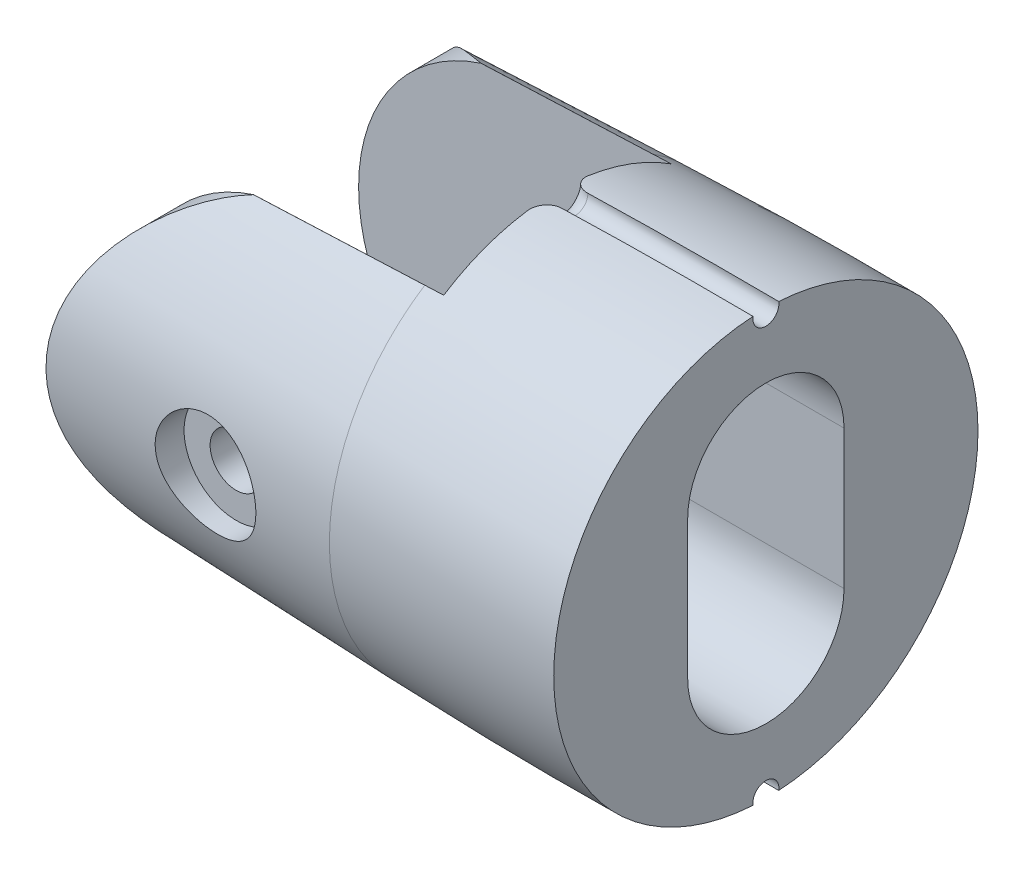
ISO-10303-21;
HEADER;
FILE_DESCRIPTION(('STEP AP214'),'2;1');
FILE_NAME('part.step','',(''),(''),'','','');
FILE_SCHEMA(('AUTOMOTIVE_DESIGN { 1 0 10303 214 1 1 1 1 }'));
ENDSEC;
DATA;
#1=APPLICATION_CONTEXT('core data for automotive mechanical design processes');
#2=APPLICATION_PROTOCOL_DEFINITION('international standard','automotive_design',2000,#1);
#3=PRODUCT_CONTEXT('',#1,'mechanical');
#4=PRODUCT('Part','Part','',(#3));
#5=PRODUCT_RELATED_PRODUCT_CATEGORY('part','',(#4));
#6=PRODUCT_DEFINITION_FORMATION('','',#4);
#7=PRODUCT_DEFINITION_CONTEXT('part definition',#1,'design');
#8=PRODUCT_DEFINITION('design','',#6,#7);
#9=PRODUCT_DEFINITION_SHAPE('','',#8);
#10=(LENGTH_UNIT() NAMED_UNIT(*) SI_UNIT(.MILLI.,.METRE.));
#11=(NAMED_UNIT(*) PLANE_ANGLE_UNIT() SI_UNIT($,.RADIAN.));
#12=(NAMED_UNIT(*) SI_UNIT($,.STERADIAN.) SOLID_ANGLE_UNIT());
#13=UNCERTAINTY_MEASURE_WITH_UNIT(LENGTH_MEASURE(1.E-05),#10,'distance_accuracy_value','');
#14=(GEOMETRIC_REPRESENTATION_CONTEXT(3) GLOBAL_UNCERTAINTY_ASSIGNED_CONTEXT((#13)) GLOBAL_UNIT_ASSIGNED_CONTEXT((#10,
#11,#12)) REPRESENTATION_CONTEXT('',''));
#15=CARTESIAN_POINT('',(0.,0.,0.));
#16=DIRECTION('',(0.,0.,1.));
#17=DIRECTION('',(1.,0.,0.));
#18=AXIS2_PLACEMENT_3D('',#15,#16,#17);
#19=CARTESIAN_POINT('',(-2.62045474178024,0.,0.));
#20=DIRECTION('',(-1.,0.,0.));
#21=DIRECTION('',(0.,0.,1.));
#22=AXIS2_PLACEMENT_3D('',#19,#20,#21);
#23=DEGENERATE_TOROIDAL_SURFACE('',#22,287.774371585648,300.,.F.);
#24=CARTESIAN_POINT('',(13.0805321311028,-11.7940897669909,0.693790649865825));
#25=CARTESIAN_POINT('',(12.830909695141,-11.8068856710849,0.699041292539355));
#26=CARTESIAN_POINT('',(12.5812624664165,-11.8193980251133,0.703769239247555));
#27=CARTESIAN_POINT('',(12.0819274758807,-11.8438493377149,0.712312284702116));
#28=CARTESIAN_POINT('',(11.8322397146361,-11.8557883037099,0.716127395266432));
#29=CARTESIAN_POINT('',(11.083081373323,-11.8907379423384,0.726402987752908));
#30=CARTESIAN_POINT('',(10.5835538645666,-11.9128793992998,0.731692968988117));
#31=CARTESIAN_POINT('',(9.58438012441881,-11.9548012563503,0.739957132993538));
#32=CARTESIAN_POINT('',(9.0847338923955,-11.9745816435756,0.742931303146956));
#33=CARTESIAN_POINT('',(7.58561586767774,-12.0303237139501,0.749364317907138));
#34=CARTESIAN_POINT('',(6.5859973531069,-12.0626847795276,0.750333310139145));
#35=CARTESIAN_POINT('',(4.77317724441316,-12.1124362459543,0.749578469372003));
#36=CARTESIAN_POINT('',(3.96001967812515,-12.1314937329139,0.748323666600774));
#37=CARTESIAN_POINT('',(2.33357283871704,-12.1630026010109,0.745446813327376));
#38=CARTESIAN_POINT('',(1.5202835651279,-12.1754539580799,0.743824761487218));
#39=CARTESIAN_POINT('',(-0.10636365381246,-12.1936883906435,0.741230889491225));
#40=CARTESIAN_POINT('',(-0.919721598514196,-12.1994715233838,0.740259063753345));
#41=CARTESIAN_POINT('',(-2.54645668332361,-12.2043410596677,0.739451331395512));
#42=CARTESIAN_POINT('',(-3.35983382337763,-12.2034274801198,0.739615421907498));
#43=CARTESIAN_POINT('',(-4.8255625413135,-12.1957516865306,0.740858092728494));
#44=CARTESIAN_POINT('',(-5.47792084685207,-12.1901828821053,0.741749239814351));
#45=CARTESIAN_POINT('',(-6.78258587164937,-12.1747587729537,0.743897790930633));
#46=CARTESIAN_POINT('',(-7.43489259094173,-12.164903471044,0.745155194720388));
#47=CARTESIAN_POINT('',(-8.73942860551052,-12.1409368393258,0.747534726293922));
#48=CARTESIAN_POINT('',(-9.39165790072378,-12.1268255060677,0.748656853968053));
#49=CARTESIAN_POINT('',(-10.6960130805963,-12.0943946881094,0.750007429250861));
#50=CARTESIAN_POINT('',(-11.3481389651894,-12.0760752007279,0.750235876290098));
#51=CARTESIAN_POINT('',(-12.0002,-12.0556755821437,0.749638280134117));
#52=B_SPLINE_CURVE_WITH_KNOTS('',3,(#24,#25,#26,#27,#28,#29,#30,#31,#32,#33,#34,#35,#36,#37,#38,
#39,#40,#41,#42,#43,#44,#45,#46,#47,#48,#49,#50,#51),.UNSPECIFIED.,.F.,.F.,(4,2,2,2,2,2,2,2,2,2,
2,2,2,4),(0.,0.750014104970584,1.50001849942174,3.00014184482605,4.50027336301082,
7.50063432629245,9.94075605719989,12.3808866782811,14.8209963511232,17.2610998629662,
19.2182341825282,21.1753672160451,23.1325018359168,25.0896377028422),.UNSPECIFIED.);
#53=CARTESIAN_POINT('',(-2.2034205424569E-11,-12.1916561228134,0.741485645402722));
#54=VERTEX_POINT('',#53);
#55=CARTESIAN_POINT('',(-11.,-12.0853296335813,0.749973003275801));
#56=VERTEX_POINT('',#55);
#57=EDGE_CURVE('E408',#54,#56,#52,.T.);
#58=ORIENTED_EDGE('',*,*,#57,.F.);
#59=CARTESIAN_POINT('',(0.,0.,0.));
#60=DIRECTION('',(1.,0.,0.));
#61=DIRECTION('',(0.,0.,-1.));
#62=AXIS2_PLACEMENT_3D('',#59,#60,#61);
#63=CIRCLE('',#62,12.2141835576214);
#64=CARTESIAN_POINT('',(0.,12.1916561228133,0.741485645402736));
#65=VERTEX_POINT('',#64);
#66=EDGE_CURVE('E50',#54,#65,#63,.F.);
#67=ORIENTED_EDGE('',*,*,#66,.T.);
#68=CARTESIAN_POINT('',(-12.0002,12.055675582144,0.749638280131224));
#69=CARTESIAN_POINT('',(-11.7503213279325,12.0634920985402,0.749880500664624));
#70=CARTESIAN_POINT('',(-11.5004331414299,12.0710037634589,0.749992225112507));
#71=CARTESIAN_POINT('',(-11.0006386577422,12.0854140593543,0.75000701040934));
#72=CARTESIAN_POINT('',(-10.750732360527,12.0923126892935,0.749910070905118));
#73=CARTESIAN_POINT('',(-10.0009631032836,12.1120846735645,0.749384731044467));
#74=CARTESIAN_POINT('',(-9.50107561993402,12.1240333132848,0.748721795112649));
#75=CARTESIAN_POINT('',(-8.50124745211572,12.1454422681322,0.747125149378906));
#76=CARTESIAN_POINT('',(-8.00130676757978,12.1549025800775,0.746191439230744));
#77=CARTESIAN_POINT('',(-7.00137681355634,12.1713172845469,0.744338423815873));
#78=CARTESIAN_POINT('',(-6.50138754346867,12.178271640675,0.743419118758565));
#79=CARTESIAN_POINT('',(-5.50137870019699,12.189661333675,0.741808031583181));
#80=CARTESIAN_POINT('',(-5.00135912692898,12.1940966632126,0.741116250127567));
#81=CARTESIAN_POINT('',(-3.76853352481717,12.2019160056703,0.739870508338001));
#82=CARTESIAN_POINT('',(-3.03571754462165,12.2038494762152,0.739530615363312));
#83=CARTESIAN_POINT('',(-1.57008978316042,12.2022793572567,0.739793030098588));
#84=CARTESIAN_POINT('',(-0.837278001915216,12.1987757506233,0.740395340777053));
#85=CARTESIAN_POINT('',(0.628311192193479,12.1863455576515,0.742299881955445));
#86=CARTESIAN_POINT('',(1.36108860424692,12.1774188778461,0.743602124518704));
#87=CARTESIAN_POINT('',(2.82655796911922,12.1541782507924,0.746310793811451));
#88=CARTESIAN_POINT('',(3.55924992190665,12.1398643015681,0.747717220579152));
#89=CARTESIAN_POINT('',(5.02463324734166,12.1059039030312,0.749708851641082));
#90=CARTESIAN_POINT('',(5.75732459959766,12.086256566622,0.750293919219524));
#91=CARTESIAN_POINT('',(7.22254320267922,12.0417096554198,0.749406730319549));
#92=CARTESIAN_POINT('',(7.95507045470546,12.0168101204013,0.747934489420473));
#93=CARTESIAN_POINT('',(9.05370483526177,11.9755981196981,0.74297020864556));
#94=CARTESIAN_POINT('',(9.41989140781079,11.9612169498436,0.740856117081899));
#95=CARTESIAN_POINT('',(10.1522031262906,11.9311822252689,0.735454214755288));
#96=CARTESIAN_POINT('',(10.5183282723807,11.9155286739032,0.732166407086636));
#97=CARTESIAN_POINT('',(11.2505176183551,11.8829648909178,0.724131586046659));
#98=CARTESIAN_POINT('',(11.6165818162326,11.8660546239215,0.719384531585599));
#99=CARTESIAN_POINT('',(12.3486254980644,11.8309960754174,0.708056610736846));
#100=CARTESIAN_POINT('',(12.714604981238,11.8128477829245,0.701475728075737));
#101=CARTESIAN_POINT('',(13.0805321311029,11.7940897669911,0.693790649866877));
#102=B_SPLINE_CURVE_WITH_KNOTS('',3,(#68,#69,#70,#71,#72,#73,#74,#75,#76,#77,#78,#79,#80,#81,
#82,#83,#84,#85,#86,#87,#88,#89,#90,#91,#92,#93,#94,#95,#96,#97,#98,#99,#100,#101),
.UNSPECIFIED.,.F.,.F.,(4,2,2,2,2,2,2,2,2,2,2,2,2,2,2,2,4),(0.,0.750002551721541,
1.50000637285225,3.0000915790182,4.50017870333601,6.00028761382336,7.50040089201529,
9.69883480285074,11.8972756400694,14.0957543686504,16.2942339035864,18.4930793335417,
20.6919081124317,21.791329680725,22.8907483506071,23.9901979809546,25.089657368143),.UNSPECIFIED.);
#103=CARTESIAN_POINT('',(-11.,12.0853296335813,0.749973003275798));
#104=VERTEX_POINT('',#103);
#105=EDGE_CURVE('E387',#104,#65,#102,.T.);
#106=ORIENTED_EDGE('',*,*,#105,.F.);
#107=CARTESIAN_POINT('',(-11.,12.0853296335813,0.749973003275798));
#108=CARTESIAN_POINT('',(-11.0320699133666,12.0844303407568,0.749981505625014));
#109=CARTESIAN_POINT('',(-11.0641150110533,12.0834328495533,0.751531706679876));
#110=CARTESIAN_POINT('',(-11.127903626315,12.0812420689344,0.757692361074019));
#111=CARTESIAN_POINT('',(-11.1596471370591,12.0800487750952,0.762302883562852));
#112=CARTESIAN_POINT('',(-11.2538267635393,12.0761851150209,0.78064756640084));
#113=CARTESIAN_POINT('',(-11.3154380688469,12.0732247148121,0.798895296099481));
#114=CARTESIAN_POINT('',(-11.4268717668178,12.0668986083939,0.843851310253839));
#115=CARTESIAN_POINT('',(-11.4772230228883,12.063623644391,0.869287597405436));
#116=CARTESIAN_POINT('',(-11.5729199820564,12.056383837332,0.928196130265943));
#117=CARTESIAN_POINT('',(-11.618267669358,12.0524192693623,0.961665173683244));
#118=CARTESIAN_POINT('',(-11.7027830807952,12.0437195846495,1.03577177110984));
#119=CARTESIAN_POINT('',(-11.7419348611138,12.0389825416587,1.07642726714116));
#120=CARTESIAN_POINT('',(-11.8128252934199,12.0286857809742,1.16369256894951));
#121=CARTESIAN_POINT('',(-11.8445613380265,12.0231257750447,1.21030446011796));
#122=CARTESIAN_POINT('',(-11.8997049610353,12.01116492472,1.30812508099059));
#123=CARTESIAN_POINT('',(-11.9231108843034,12.0047639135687,1.35933472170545));
#124=CARTESIAN_POINT('',(-11.9609085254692,11.9911611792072,1.46485111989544));
#125=CARTESIAN_POINT('',(-11.9753089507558,11.9839602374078,1.51915483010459));
#126=CARTESIAN_POINT('',(-11.9900043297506,11.972544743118,1.60248779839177));
#127=CARTESIAN_POINT('',(-11.9937531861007,11.9685784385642,1.63098235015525));
#128=CARTESIAN_POINT('',(-11.9987488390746,11.9604958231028,1.68811760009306));
#129=CARTESIAN_POINT('',(-12.0000000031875,11.9563797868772,1.71675795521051));
#130=CARTESIAN_POINT('',(-12.0000000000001,11.9521961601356,1.74540235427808));
#131=B_SPLINE_CURVE_WITH_KNOTS('',3,(#107,#108,#109,#110,#111,#112,#113,#114,#115,#116,#117,
#118,#119,#120,#121,#122,#123,#124,#125,#126,#127,#128,#129,#130),.UNSPECIFIED.,.F.,.F.,(4,2,2,
2,2,2,2,2,2,2,2,4),(0.,0.0961675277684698,0.192337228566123,0.384009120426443,0.552770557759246,
0.721464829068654,0.890586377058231,1.05976729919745,1.22898181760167,1.39803246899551,
1.48497510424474,1.57176557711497),.UNSPECIFIED.);
#132=CARTESIAN_POINT('',(-12.,11.9521961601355,1.74540235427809));
#133=VERTEX_POINT('',#132);
#134=EDGE_CURVE('E426',#104,#133,#131,.T.);
#135=ORIENTED_EDGE('',*,*,#134,.T.);
#136=CARTESIAN_POINT('',(-12.,0.,0.));
#137=DIRECTION('',(-1.,0.,0.));
#138=DIRECTION('',(0.,0.,1.));
#139=AXIS2_PLACEMENT_3D('',#136,#137,#138);
#140=CIRCLE('',#139,12.0789661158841);
#141=CARTESIAN_POINT('',(-12.,10.1488384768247,6.55));
#142=VERTEX_POINT('',#141);
#143=EDGE_CURVE('E541',#142,#133,#140,.T.);
#144=ORIENTED_EDGE('',*,*,#143,.F.);
#145=CARTESIAN_POINT('',(-12.6876363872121,10.1222885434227,6.55));
#146=CARTESIAN_POINT('',(-12.5730364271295,10.1268716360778,6.55));
#147=CARTESIAN_POINT('',(-12.4584334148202,10.1313756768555,6.55));
#148=CARTESIAN_POINT('',(-12.2292212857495,10.1402256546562,6.55));
#149=CARTESIAN_POINT('',(-12.1146121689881,10.1445715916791,6.55));
#150=CARTESIAN_POINT('',(-12.,10.1488384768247,6.55));
#151=B_SPLINE_CURVE_WITH_KNOTS('',3,(#145,#146,#147,#148,#149,#150),.UNSPECIFIED.,.F.,.F.,(4,2,
4),(0.,0.344074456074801,0.688148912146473),.UNSPECIFIED.);
#152=CARTESIAN_POINT('',(-12.6876363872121,10.1222885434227,6.55));
#153=VERTEX_POINT('',#152);
#154=EDGE_CURVE('E371',#153,#142,#151,.T.);
#155=ORIENTED_EDGE('',*,*,#154,.F.);
#156=CARTESIAN_POINT('',(-13.0903037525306,10.1053582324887,6.55077170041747));
#157=CARTESIAN_POINT('',(-13.023192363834,10.1081799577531,6.55072731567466));
#158=CARTESIAN_POINT('',(-12.956081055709,10.1110016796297,6.55064081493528));
#159=CARTESIAN_POINT('',(-12.8218586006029,10.1166451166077,6.55038358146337));
#160=CARTESIAN_POINT('',(-12.7547474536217,10.1194668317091,6.55021284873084));
#161=CARTESIAN_POINT('',(-12.6876363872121,10.1222885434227,6.55000000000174));
#162=B_SPLINE_CURVE_WITH_KNOTS('',3,(#156,#157,#158,#159,#160,#161),.UNSPECIFIED.,.F.,.F.,(4,2,
4),(0.,0.201511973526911,0.403023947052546),.UNSPECIFIED.);
#163=CARTESIAN_POINT('',(-13.0903037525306,10.1053582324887,6.5507717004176));
#164=VERTEX_POINT('',#163);
#165=EDGE_CURVE('E338',#164,#153,#162,.T.);
#166=ORIENTED_EDGE('',*,*,#165,.F.);
#167=CARTESIAN_POINT('',(-13.0903037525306,0.,0.));
#168=DIRECTION('',(1.,0.,0.));
#169=DIRECTION('',(0.,0.,-1.));
#170=AXIS2_PLACEMENT_3D('',#167,#168,#169);
#171=CIRCLE('',#170,12.0428765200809);
#172=CARTESIAN_POINT('',(-13.0903037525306,-10.1053582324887,6.55077170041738));
#173=VERTEX_POINT('',#172);
#174=EDGE_CURVE('E539',#173,#164,#171,.F.);
#175=ORIENTED_EDGE('',*,*,#174,.F.);
#176=CARTESIAN_POINT('',(-12.6876363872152,-10.1222885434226,6.55));
#177=CARTESIAN_POINT('',(-12.7547474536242,-10.119466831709,6.55021284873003));
#178=CARTESIAN_POINT('',(-12.8218586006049,-10.1166451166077,6.55038358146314));
#179=CARTESIAN_POINT('',(-12.95608105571,-10.1110016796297,6.55064081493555));
#180=CARTESIAN_POINT('',(-13.0231923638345,-10.1081799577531,6.55072731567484));
#181=CARTESIAN_POINT('',(-13.0903037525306,-10.1053582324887,6.55077170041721));
#182=B_SPLINE_CURVE_WITH_KNOTS('',3,(#176,#177,#178,#179,#180,#181),.UNSPECIFIED.,.F.,.F.,(4,2,
4),(0.,0.201511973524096,0.403023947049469),.UNSPECIFIED.);
#183=CARTESIAN_POINT('',(-12.6876363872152,-10.1222885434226,6.55));
#184=VERTEX_POINT('',#183);
#185=EDGE_CURVE('E332',#184,#173,#182,.T.);
#186=ORIENTED_EDGE('',*,*,#185,.F.);
#187=CARTESIAN_POINT('',(-12.,-10.1488384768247,6.55));
#188=CARTESIAN_POINT('',(-12.1146121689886,-10.1445715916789,6.55));
#189=CARTESIAN_POINT('',(-12.2292212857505,-10.140225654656,6.55));
#190=CARTESIAN_POINT('',(-12.4584334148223,-10.1313756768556,6.55));
#191=CARTESIAN_POINT('',(-12.5730364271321,-10.1268716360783,6.55));
#192=CARTESIAN_POINT('',(-12.6876363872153,-10.1222885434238,6.55));
#193=B_SPLINE_CURVE_WITH_KNOTS('',3,(#187,#188,#189,#190,#191,#192),.UNSPECIFIED.,.F.,.F.,(4,2,
4),(0.,0.344074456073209,0.688148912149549),.UNSPECIFIED.);
#194=CARTESIAN_POINT('',(-12.,-10.1488384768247,6.55));
#195=VERTEX_POINT('',#194);
#196=EDGE_CURVE('E339',#195,#184,#193,.T.);
#197=ORIENTED_EDGE('',*,*,#196,.F.);
#198=CARTESIAN_POINT('',(-12.,0.,0.));
#199=DIRECTION('',(-1.,0.,0.));
#200=DIRECTION('',(0.,0.,1.));
#201=AXIS2_PLACEMENT_3D('',#198,#199,#200);
#202=CIRCLE('',#201,12.0789661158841);
#203=CARTESIAN_POINT('',(-12.,-11.9521961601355,1.74540235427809));
#204=VERTEX_POINT('',#203);
#205=EDGE_CURVE('E544',#204,#195,#202,.T.);
#206=ORIENTED_EDGE('',*,*,#205,.F.);
#207=CARTESIAN_POINT('',(-12.,-11.9521961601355,1.74540235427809));
#208=CARTESIAN_POINT('',(-11.9999997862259,-11.9562767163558,1.71746316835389));
#209=CARTESIAN_POINT('',(-11.9988096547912,-11.9602930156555,1.68952823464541));
#210=CARTESIAN_POINT('',(-11.9940611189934,-11.9681770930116,1.63384063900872));
#211=CARTESIAN_POINT('',(-11.9905028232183,-11.9720448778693,1.60608796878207));
#212=CARTESIAN_POINT('',(-11.9763085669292,-11.98338346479,1.52345152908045));
#213=CARTESIAN_POINT('',(-11.9621531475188,-11.9906031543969,1.46909558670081));
#214=CARTESIAN_POINT('',(-11.9248437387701,-12.0042422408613,1.36345944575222));
#215=CARTESIAN_POINT('',(-11.901685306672,-12.0106612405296,1.31218078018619));
#216=CARTESIAN_POINT('',(-11.8470262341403,-12.0226594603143,1.21417694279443));
#217=CARTESIAN_POINT('',(-11.8155271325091,-12.0282388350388,1.1674509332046));
#218=CARTESIAN_POINT('',(-11.7450805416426,-12.0385758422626,1.07990145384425));
#219=CARTESIAN_POINT('',(-11.7061333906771,-12.0433335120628,1.03907771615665));
#220=CARTESIAN_POINT('',(-11.6218844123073,-12.0520848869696,0.96449793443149));
#221=CARTESIAN_POINT('',(-11.5765811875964,-12.0560784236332,0.930743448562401));
#222=CARTESIAN_POINT('',(-11.4808869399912,-12.0633728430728,0.87127064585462));
#223=CARTESIAN_POINT('',(-11.4304923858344,-12.0666732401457,0.845557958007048));
#224=CARTESIAN_POINT('',(-11.326081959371,-12.0726389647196,0.802960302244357));
#225=CARTESIAN_POINT('',(-11.2720684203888,-12.0753046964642,0.786069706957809));
#226=CARTESIAN_POINT('',(-11.1814237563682,-12.0791996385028,0.765918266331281));
#227=CARTESIAN_POINT('',(-11.1453788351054,-12.0806039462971,0.759951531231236));
#228=CARTESIAN_POINT('',(-11.0728959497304,-12.0831573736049,0.751983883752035));
#229=CARTESIAN_POINT('',(-11.0364586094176,-12.0843068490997,0.749977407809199));
#230=CARTESIAN_POINT('',(-11.,-12.0853296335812,0.749973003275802));
#231=B_SPLINE_CURVE_WITH_KNOTS('',3,(#207,#208,#209,#210,#211,#212,#213,#214,#215,#216,#217,
#218,#219,#220,#221,#222,#223,#224,#225,#226,#227,#228,#229,#230),.UNSPECIFIED.,.F.,.F.,(4,2,2,
2,2,2,2,2,2,2,2,4),(0.,0.0846548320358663,0.169305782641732,0.338327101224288,0.507431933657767,
0.676505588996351,0.845571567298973,1.01467477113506,1.18389607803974,1.35300931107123,
1.46249391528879,1.57182460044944),.UNSPECIFIED.);
#232=EDGE_CURVE('E431',#204,#56,#231,.T.);
#233=ORIENTED_EDGE('',*,*,#232,.T.);
#234=EDGE_LOOP('',(#58,#67,#106,#135,#144,#155,#166,#175,#186,#197,#206,#233));
#235=FACE_BOUND('',#234,.T.);
#236=ADVANCED_FACE('F34',(#235),#23,.F.);
#237=CARTESIAN_POINT('',(13.0805321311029,11.7940897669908,-0.693790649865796));
#238=CARTESIAN_POINT('',(12.8309096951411,11.8068856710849,-0.699041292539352));
#239=CARTESIAN_POINT('',(12.5812624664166,11.8193980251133,-0.70376923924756));
#240=CARTESIAN_POINT('',(12.0819274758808,11.8438493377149,-0.712312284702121));
#241=CARTESIAN_POINT('',(11.8322397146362,11.8557883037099,-0.71612739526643));
#242=CARTESIAN_POINT('',(11.0830813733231,11.8907379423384,-0.726402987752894));
#243=CARTESIAN_POINT('',(10.5835538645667,11.9128793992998,-0.731692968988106));
#244=CARTESIAN_POINT('',(9.58438012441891,11.9548012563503,-0.739957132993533));
#245=CARTESIAN_POINT('',(9.0847338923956,11.9745816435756,-0.742931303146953));
#246=CARTESIAN_POINT('',(7.58561586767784,12.0303237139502,-0.749364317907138));
#247=CARTESIAN_POINT('',(6.585997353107,12.0626847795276,-0.750333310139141));
#248=CARTESIAN_POINT('',(4.7731772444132,12.1124362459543,-0.749578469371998));
#249=CARTESIAN_POINT('',(3.96001967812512,12.1314937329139,-0.74832366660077));
#250=CARTESIAN_POINT('',(2.3335728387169,12.1630026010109,-0.745446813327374));
#251=CARTESIAN_POINT('',(1.52028356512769,12.1754539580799,-0.743824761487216));
#252=CARTESIAN_POINT('',(-0.106363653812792,12.1936883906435,-0.741230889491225));
#253=CARTESIAN_POINT('',(-0.91972159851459,12.1994715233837,-0.740259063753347));
#254=CARTESIAN_POINT('',(-2.54645668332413,12.2043410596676,-0.739451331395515));
#255=CARTESIAN_POINT('',(-3.35983382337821,12.2034274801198,-0.739615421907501));
#256=CARTESIAN_POINT('',(-4.82556254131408,12.1957516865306,-0.740858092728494));
#257=CARTESIAN_POINT('',(-5.4779208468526,12.1901828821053,-0.741749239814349));
#258=CARTESIAN_POINT('',(-6.7825858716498,12.1747587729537,-0.743897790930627));
#259=CARTESIAN_POINT('',(-7.4348925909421,12.164903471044,-0.74515519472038));
#260=CARTESIAN_POINT('',(-8.7394286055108,12.1409368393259,-0.747534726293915));
#261=CARTESIAN_POINT('',(-9.391657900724,12.1268255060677,-0.748656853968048));
#262=CARTESIAN_POINT('',(-10.6960130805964,12.0943946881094,-0.750007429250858));
#263=CARTESIAN_POINT('',(-11.3481389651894,12.0760752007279,-0.750235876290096));
#264=CARTESIAN_POINT('',(-12.0002,12.0556755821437,-0.749638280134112));
#265=B_SPLINE_CURVE_WITH_KNOTS('',3,(#237,#238,#239,#240,#241,#242,#243,#244,#245,#246,#247,
#248,#249,#250,#251,#252,#253,#254,#255,#256,#257,#258,#259,#260,#261,#262,#263,#264),
.UNSPECIFIED.,.F.,.F.,(4,2,2,2,2,2,2,2,2,2,2,2,2,4),(0.,0.750014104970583,1.50001849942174,
3.00014184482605,4.50027336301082,7.50063432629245,9.94075605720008,12.3808866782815,
14.8209963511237,17.2610998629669,19.2182341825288,21.1753672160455,23.1325018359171,
25.0896377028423),.UNSPECIFIED.);
#266=CARTESIAN_POINT('',(0.,12.1916561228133,-0.741485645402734));
#267=VERTEX_POINT('',#266);
#268=CARTESIAN_POINT('',(-11.,12.0853296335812,-0.749973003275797));
#269=VERTEX_POINT('',#268);
#270=EDGE_CURVE('E395',#267,#269,#265,.T.);
#271=ORIENTED_EDGE('',*,*,#270,.F.);
#272=CARTESIAN_POINT('',(0.,0.,0.));
#273=DIRECTION('',(1.,0.,0.));
#274=DIRECTION('',(0.,0.,-1.));
#275=AXIS2_PLACEMENT_3D('',#272,#273,#274);
#276=CIRCLE('',#275,12.2141835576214);
#277=CARTESIAN_POINT('',(0.,-12.1916561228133,-0.741485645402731));
#278=VERTEX_POINT('',#277);
#279=EDGE_CURVE('E595',#267,#278,#276,.F.);
#280=ORIENTED_EDGE('',*,*,#279,.T.);
#281=CARTESIAN_POINT('',(-12.0002,-12.055675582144,-0.74963828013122));
#282=CARTESIAN_POINT('',(-11.7503213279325,-12.0634920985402,-0.74988050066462));
#283=CARTESIAN_POINT('',(-11.5004331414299,-12.0710037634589,-0.749992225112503));
#284=CARTESIAN_POINT('',(-11.0006386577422,-12.0854140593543,-0.750007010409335));
#285=CARTESIAN_POINT('',(-10.750732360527,-12.0923126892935,-0.749910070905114));
#286=CARTESIAN_POINT('',(-10.0009631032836,-12.1120846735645,-0.749384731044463));
#287=CARTESIAN_POINT('',(-9.50107561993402,-12.1240333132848,-0.748721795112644));
#288=CARTESIAN_POINT('',(-8.50124745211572,-12.1454422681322,-0.747125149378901));
#289=CARTESIAN_POINT('',(-8.00130676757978,-12.1549025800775,-0.74619143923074));
#290=CARTESIAN_POINT('',(-7.00137681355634,-12.1713172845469,-0.744338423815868));
#291=CARTESIAN_POINT('',(-6.50138754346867,-12.178271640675,-0.743419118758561));
#292=CARTESIAN_POINT('',(-5.50137870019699,-12.189661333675,-0.741808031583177));
#293=CARTESIAN_POINT('',(-5.00135912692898,-12.1940966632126,-0.741116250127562));
#294=CARTESIAN_POINT('',(-3.76853352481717,-12.2019160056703,-0.739870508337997));
#295=CARTESIAN_POINT('',(-3.03571754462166,-12.2038494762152,-0.739530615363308));
#296=CARTESIAN_POINT('',(-1.57008978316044,-12.2022793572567,-0.739793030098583));
#297=CARTESIAN_POINT('',(-0.837278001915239,-12.1987757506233,-0.740395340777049));
#298=CARTESIAN_POINT('',(0.628311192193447,-12.1863455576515,-0.74229988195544));
#299=CARTESIAN_POINT('',(1.36108860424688,-12.1774188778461,-0.743602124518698));
#300=CARTESIAN_POINT('',(2.82655796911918,-12.1541782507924,-0.746310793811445));
#301=CARTESIAN_POINT('',(3.55924992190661,-12.1398643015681,-0.747717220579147));
#302=CARTESIAN_POINT('',(5.02463324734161,-12.1059039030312,-0.749708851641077));
#303=CARTESIAN_POINT('',(5.7573245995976,-12.086256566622,-0.75029391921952));
#304=CARTESIAN_POINT('',(7.22254320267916,-12.0417096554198,-0.749406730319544));
#305=CARTESIAN_POINT('',(7.95507045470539,-12.0168101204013,-0.747934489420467));
#306=CARTESIAN_POINT('',(9.0537048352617,-11.9755981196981,-0.742970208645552));
#307=CARTESIAN_POINT('',(9.41989140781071,-11.9612169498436,-0.74085611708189));
#308=CARTESIAN_POINT('',(10.1522031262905,-11.9311822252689,-0.735454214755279));
#309=CARTESIAN_POINT('',(10.5183282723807,-11.9155286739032,-0.732166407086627));
#310=CARTESIAN_POINT('',(11.250517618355,-11.8829648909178,-0.724131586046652));
#311=CARTESIAN_POINT('',(11.6165818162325,-11.8660546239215,-0.719384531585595));
#312=CARTESIAN_POINT('',(12.3486254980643,-11.8309960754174,-0.70805661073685));
#313=CARTESIAN_POINT('',(12.7146049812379,-11.8128477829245,-0.701475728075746));
#314=CARTESIAN_POINT('',(13.0805321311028,-11.7940897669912,-0.693790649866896));
#315=B_SPLINE_CURVE_WITH_KNOTS('',3,(#281,#282,#283,#284,#285,#286,#287,#288,#289,#290,#291,
#292,#293,#294,#295,#296,#297,#298,#299,#300,#301,#302,#303,#304,#305,#306,#307,#308,#309,#310,
#311,#312,#313,#314),.UNSPECIFIED.,.F.,.F.,(4,2,2,2,2,2,2,2,2,2,2,2,2,2,2,2,4),(0.,
0.750002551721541,1.50000637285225,3.0000915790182,4.50017870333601,6.00028761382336,
7.50040089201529,9.69883480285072,11.8972756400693,14.0957543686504,16.2942339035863,
18.4930793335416,20.6919081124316,21.7913296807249,22.890748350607,23.9901979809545,
25.0896573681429),.UNSPECIFIED.);
#316=CARTESIAN_POINT('',(-11.,-12.0853296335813,-0.749973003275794));
#317=VERTEX_POINT('',#316);
#318=EDGE_CURVE('E401',#317,#278,#315,.T.);
#319=ORIENTED_EDGE('',*,*,#318,.F.);
#320=CARTESIAN_POINT('',(-11.,-12.0853296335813,-0.749973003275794));
#321=CARTESIAN_POINT('',(-11.0320699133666,-12.0844303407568,-0.74998150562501));
#322=CARTESIAN_POINT('',(-11.0641150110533,-12.0834328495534,-0.751531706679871));
#323=CARTESIAN_POINT('',(-11.127903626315,-12.0812420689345,-0.757692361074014));
#324=CARTESIAN_POINT('',(-11.1596471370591,-12.0800487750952,-0.762302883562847));
#325=CARTESIAN_POINT('',(-11.2538267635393,-12.0761851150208,-0.780647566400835));
#326=CARTESIAN_POINT('',(-11.3154380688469,-12.073224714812,-0.798895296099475));
#327=CARTESIAN_POINT('',(-11.4268717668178,-12.0668986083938,-0.843851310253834));
#328=CARTESIAN_POINT('',(-11.4772230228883,-12.0636236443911,-0.869287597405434));
#329=CARTESIAN_POINT('',(-11.5729199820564,-12.0563838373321,-0.928196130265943));
#330=CARTESIAN_POINT('',(-11.618267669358,-12.0524192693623,-0.961665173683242));
#331=CARTESIAN_POINT('',(-11.7027830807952,-12.0437195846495,-1.03577177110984));
#332=CARTESIAN_POINT('',(-11.7419348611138,-12.0389825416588,-1.07642726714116));
#333=CARTESIAN_POINT('',(-11.8128252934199,-12.0286857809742,-1.16369256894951));
#334=CARTESIAN_POINT('',(-11.8445613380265,-12.0231257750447,-1.21030446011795));
#335=CARTESIAN_POINT('',(-11.8997049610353,-12.01116492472,-1.30812508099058));
#336=CARTESIAN_POINT('',(-11.9231108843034,-12.0047639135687,-1.35933472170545));
#337=CARTESIAN_POINT('',(-11.9609085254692,-11.9911611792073,-1.46485111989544));
#338=CARTESIAN_POINT('',(-11.9753089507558,-11.9839602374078,-1.51915483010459));
#339=CARTESIAN_POINT('',(-11.9900043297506,-11.972544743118,-1.60248779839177));
#340=CARTESIAN_POINT('',(-11.9937531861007,-11.9685784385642,-1.63098235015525));
#341=CARTESIAN_POINT('',(-11.9987488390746,-11.9604958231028,-1.68811760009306));
#342=CARTESIAN_POINT('',(-12.0000000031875,-11.9563797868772,-1.7167579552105));
#343=CARTESIAN_POINT('',(-12.0000000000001,-11.9521961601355,-1.74540235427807));
#344=B_SPLINE_CURVE_WITH_KNOTS('',3,(#320,#321,#322,#323,#324,#325,#326,#327,#328,#329,#330,
#331,#332,#333,#334,#335,#336,#337,#338,#339,#340,#341,#342,#343),.UNSPECIFIED.,.F.,.F.,(4,2,2,
2,2,2,2,2,2,2,2,4),(0.,0.0961675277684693,0.192337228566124,0.384009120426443,0.552770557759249,
0.72146482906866,0.890586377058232,1.05976729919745,1.22898181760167,1.39803246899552,
1.48497510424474,1.57176557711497),.UNSPECIFIED.);
#345=CARTESIAN_POINT('',(-12.,-11.9521961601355,-1.74540235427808));
#346=VERTEX_POINT('',#345);
#347=EDGE_CURVE('E420',#317,#346,#344,.T.);
#348=ORIENTED_EDGE('',*,*,#347,.T.);
#349=CARTESIAN_POINT('',(-12.,-10.1488384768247,-6.55));
#350=VERTEX_POINT('',#349);
#351=EDGE_CURVE('E542',#350,#346,#202,.T.);
#352=ORIENTED_EDGE('',*,*,#351,.F.);
#353=CARTESIAN_POINT('',(-12.6876363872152,-10.1222885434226,-6.55));
#354=CARTESIAN_POINT('',(-12.5730364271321,-10.1268716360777,-6.55));
#355=CARTESIAN_POINT('',(-12.4584334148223,-10.1313756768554,-6.55));
#356=CARTESIAN_POINT('',(-12.2292212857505,-10.1402256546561,-6.55));
#357=CARTESIAN_POINT('',(-12.1146121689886,-10.1445715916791,-6.55));
#358=CARTESIAN_POINT('',(-12.,-10.1488384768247,-6.55));
#359=B_SPLINE_CURVE_WITH_KNOTS('',3,(#353,#354,#355,#356,#357,#358),.UNSPECIFIED.,.F.,.F.,(4,2,
4),(0.,0.344074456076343,0.688148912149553),.UNSPECIFIED.);
#360=CARTESIAN_POINT('',(-12.6876363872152,-10.1222885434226,-6.55));
#361=VERTEX_POINT('',#360);
#362=EDGE_CURVE('E365',#361,#350,#359,.T.);
#363=ORIENTED_EDGE('',*,*,#362,.F.);
#364=CARTESIAN_POINT('',(-13.0903037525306,-10.1053582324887,-6.55077170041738));
#365=CARTESIAN_POINT('',(-13.0231923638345,-10.1081799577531,-6.55072731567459));
#366=CARTESIAN_POINT('',(-12.95608105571,-10.1110016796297,-6.55064081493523));
#367=CARTESIAN_POINT('',(-12.8218586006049,-10.1166451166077,-6.55038358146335));
#368=CARTESIAN_POINT('',(-12.7547474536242,-10.119466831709,-6.55021284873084));
#369=CARTESIAN_POINT('',(-12.6876363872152,-10.1222885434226,-6.55000000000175));
#370=B_SPLINE_CURVE_WITH_KNOTS('',3,(#364,#365,#366,#367,#368,#369),.UNSPECIFIED.,.F.,.F.,(4,2,
4),(0.,0.201511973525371,0.403023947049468),.UNSPECIFIED.);
#371=CARTESIAN_POINT('',(-13.0903037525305,-10.1053582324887,-6.55077170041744));
#372=VERTEX_POINT('',#371);
#373=EDGE_CURVE('E325',#372,#361,#370,.T.);
#374=ORIENTED_EDGE('',*,*,#373,.F.);
#375=CARTESIAN_POINT('',(-13.0903037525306,0.,0.));
#376=DIRECTION('',(1.,0.,0.));
#377=DIRECTION('',(0.,0.,-1.));
#378=AXIS2_PLACEMENT_3D('',#375,#376,#377);
#379=CIRCLE('',#378,12.0428765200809);
#380=CARTESIAN_POINT('',(-13.0903037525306,10.1053582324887,-6.5507717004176));
#381=VERTEX_POINT('',#380);
#382=EDGE_CURVE('E556',#381,#372,#379,.F.);
#383=ORIENTED_EDGE('',*,*,#382,.F.);
#384=CARTESIAN_POINT('',(-12.6876363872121,10.1222885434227,-6.55));
#385=CARTESIAN_POINT('',(-12.7547474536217,10.1194668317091,-6.55021284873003));
#386=CARTESIAN_POINT('',(-12.8218586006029,10.1166451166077,-6.55038358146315));
#387=CARTESIAN_POINT('',(-12.956081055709,10.1110016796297,-6.55064081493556));
#388=CARTESIAN_POINT('',(-13.023192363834,10.1081799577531,-6.55072731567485));
#389=CARTESIAN_POINT('',(-13.0903037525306,10.1053582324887,-6.55077170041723));
#390=B_SPLINE_CURVE_WITH_KNOTS('',3,(#384,#385,#386,#387,#388,#389),.UNSPECIFIED.,.F.,.F.,(4,2,
4),(0.,0.201511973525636,0.403023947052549),.UNSPECIFIED.);
#391=CARTESIAN_POINT('',(-12.6876363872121,10.1222885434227,-6.55));
#392=VERTEX_POINT('',#391);
#393=EDGE_CURVE('E380',#392,#381,#390,.T.);
#394=ORIENTED_EDGE('',*,*,#393,.F.);
#395=CARTESIAN_POINT('',(-12.,10.1488384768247,-6.55));
#396=CARTESIAN_POINT('',(-12.114612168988,10.1445715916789,-6.55));
#397=CARTESIAN_POINT('',(-12.2292212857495,10.140225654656,-6.55));
#398=CARTESIAN_POINT('',(-12.4584334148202,10.1313756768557,-6.55));
#399=CARTESIAN_POINT('',(-12.5730364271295,10.1268716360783,-6.55));
#400=CARTESIAN_POINT('',(-12.6876363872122,10.1222885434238,-6.55));
#401=B_SPLINE_CURVE_WITH_KNOTS('',3,(#395,#396,#397,#398,#399,#400),.UNSPECIFIED.,.F.,.F.,(4,2,
4),(0.,0.344074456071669,0.688148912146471),.UNSPECIFIED.);
#402=CARTESIAN_POINT('',(-12.,10.1488384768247,-6.55));
#403=VERTEX_POINT('',#402);
#404=EDGE_CURVE('E359',#403,#392,#401,.T.);
#405=ORIENTED_EDGE('',*,*,#404,.F.);
#406=CARTESIAN_POINT('',(-12.,11.9521961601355,-1.74540235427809));
#407=VERTEX_POINT('',#406);
#408=EDGE_CURVE('E549',#407,#403,#140,.T.);
#409=ORIENTED_EDGE('',*,*,#408,.F.);
#410=CARTESIAN_POINT('',(-12.,11.9521961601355,-1.74540235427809));
#411=CARTESIAN_POINT('',(-11.9999997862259,11.9562767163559,-1.71746316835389));
#412=CARTESIAN_POINT('',(-11.9988096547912,11.9602930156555,-1.68952823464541));
#413=CARTESIAN_POINT('',(-11.9940611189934,11.9681770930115,-1.63384063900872));
#414=CARTESIAN_POINT('',(-11.9905028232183,11.9720448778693,-1.60608796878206));
#415=CARTESIAN_POINT('',(-11.9763085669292,11.98338346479,-1.52345152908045));
#416=CARTESIAN_POINT('',(-11.9621531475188,11.9906031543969,-1.46909558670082));
#417=CARTESIAN_POINT('',(-11.9248437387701,12.0042422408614,-1.36345944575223));
#418=CARTESIAN_POINT('',(-11.901685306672,12.0106612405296,-1.3121807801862));
#419=CARTESIAN_POINT('',(-11.8470262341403,12.0226594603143,-1.21417694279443));
#420=CARTESIAN_POINT('',(-11.8155271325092,12.0282388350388,-1.1674509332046));
#421=CARTESIAN_POINT('',(-11.7450805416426,12.0385758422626,-1.07990145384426));
#422=CARTESIAN_POINT('',(-11.7061333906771,12.0433335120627,-1.03907771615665));
#423=CARTESIAN_POINT('',(-11.6218844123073,12.0520848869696,-0.964497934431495));
#424=CARTESIAN_POINT('',(-11.5765811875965,12.0560784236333,-0.930743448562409));
#425=CARTESIAN_POINT('',(-11.4808869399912,12.0633728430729,-0.871270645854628));
#426=CARTESIAN_POINT('',(-11.4304923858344,12.0666732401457,-0.845557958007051));
#427=CARTESIAN_POINT('',(-11.326081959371,12.0726389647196,-0.802960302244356));
#428=CARTESIAN_POINT('',(-11.2720684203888,12.0753046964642,-0.786069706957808));
#429=CARTESIAN_POINT('',(-11.1814237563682,12.0791996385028,-0.765918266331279));
#430=CARTESIAN_POINT('',(-11.1453788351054,12.0806039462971,-0.759951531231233));
#431=CARTESIAN_POINT('',(-11.0728959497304,12.0831573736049,-0.75198388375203));
#432=CARTESIAN_POINT('',(-11.0364586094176,12.0843068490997,-0.749977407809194));
#433=CARTESIAN_POINT('',(-11.,12.0853296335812,-0.749973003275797));
#434=B_SPLINE_CURVE_WITH_KNOTS('',3,(#410,#411,#412,#413,#414,#415,#416,#417,#418,#419,#420,
#421,#422,#423,#424,#425,#426,#427,#428,#429,#430,#431,#432,#433),.UNSPECIFIED.,.F.,.F.,(4,2,2,
2,2,2,2,2,2,2,2,4),(0.,0.0846548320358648,0.169305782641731,0.338327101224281,0.507431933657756,
0.67650558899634,0.845571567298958,1.01467477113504,1.18389607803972,1.35300931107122,
1.46249391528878,1.57182460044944),.UNSPECIFIED.);
#435=EDGE_CURVE('E415',#407,#269,#434,.T.);
#436=ORIENTED_EDGE('',*,*,#435,.T.);
#437=EDGE_LOOP('',(#271,#280,#319,#348,#352,#363,#374,#383,#394,#405,#409,#436));
#438=FACE_BOUND('',#437,.T.);
#439=ADVANCED_FACE('F350',(#438),#23,.F.);
#440=CARTESIAN_POINT('',(35.,12.0789661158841,0.));
#441=DIRECTION('',(-1.,0.,0.));
#442=DIRECTION('',(0.,0.,1.));
#443=AXIS2_PLACEMENT_3D('',#440,#441,#442);
#444=CYLINDRICAL_SURFACE('',#443,0.75);
#445=CARTESIAN_POINT('',(0.,12.0789661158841,0.));
#446=DIRECTION('',(1.,0.,0.));
#447=DIRECTION('',(0.,0.,-1.));
#448=AXIS2_PLACEMENT_3D('',#445,#446,#447);
#449=CIRCLE('',#448,0.75);
#450=EDGE_CURVE('E843',#267,#65,#449,.F.);
#451=ORIENTED_EDGE('',*,*,#450,.F.);
#452=ORIENTED_EDGE('',*,*,#270,.T.);
#453=CARTESIAN_POINT('',(-11.,12.0789661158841,0.));
#454=DIRECTION('',(1.,0.,0.));
#455=DIRECTION('',(0.,0.,-1.));
#456=AXIS2_PLACEMENT_3D('',#453,#454,#455);
#457=CIRCLE('',#456,0.75);
#458=EDGE_CURVE('E43',#269,#104,#457,.F.);
#459=ORIENTED_EDGE('',*,*,#458,.T.);
#460=ORIENTED_EDGE('',*,*,#105,.T.);
#461=EDGE_LOOP('',(#451,#452,#459,#460));
#462=FACE_BOUND('',#461,.T.);
#463=ADVANCED_FACE('F443',(#462),#444,.F.);
#464=CARTESIAN_POINT('',(35.,-12.0789661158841,0.));
#465=DIRECTION('',(-1.,0.,0.));
#466=DIRECTION('',(0.,0.,1.));
#467=AXIS2_PLACEMENT_3D('',#464,#465,#466);
#468=CYLINDRICAL_SURFACE('',#467,0.75);
#469=CARTESIAN_POINT('',(0.,-12.0789661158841,0.));
#470=DIRECTION('',(1.,0.,0.));
#471=DIRECTION('',(0.,0.,-1.));
#472=AXIS2_PLACEMENT_3D('',#469,#470,#471);
#473=CIRCLE('',#472,0.75);
#474=EDGE_CURVE('E594',#54,#278,#473,.F.);
#475=ORIENTED_EDGE('',*,*,#474,.F.);
#476=ORIENTED_EDGE('',*,*,#57,.T.);
#477=CARTESIAN_POINT('',(-11.,-12.0789661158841,0.));
#478=DIRECTION('',(1.,0.,0.));
#479=DIRECTION('',(0.,0.,-1.));
#480=AXIS2_PLACEMENT_3D('',#477,#478,#479);
#481=CIRCLE('',#480,0.75);
#482=EDGE_CURVE('E591',#56,#317,#481,.F.);
#483=ORIENTED_EDGE('',*,*,#482,.T.);
#484=ORIENTED_EDGE('',*,*,#318,.T.);
#485=EDGE_LOOP('',(#475,#476,#483,#484));
#486=FACE_BOUND('',#485,.T.);
#487=ADVANCED_FACE('F593',(#486),#468,.F.);
#488=CARTESIAN_POINT('',(8.,4.,0.));
#489=DIRECTION('',(-1.,0.,0.));
#490=DIRECTION('',(0.,0.,1.));
#491=AXIS2_PLACEMENT_3D('',#488,#489,#490);
#492=CYLINDRICAL_SURFACE('',#491,4.5);
#493=CARTESIAN_POINT('',(0.,4.,0.));
#494=DIRECTION('',(1.,0.,0.));
#495=DIRECTION('',(0.,0.,-1.));
#496=AXIS2_PLACEMENT_3D('',#493,#494,#495);
#497=CIRCLE('',#496,4.5);
#498=CARTESIAN_POINT('',(0.,4.,4.5));
#499=VERTEX_POINT('',#498);
#500=CARTESIAN_POINT('',(0.,4.,-4.5));
#501=VERTEX_POINT('',#500);
#502=EDGE_CURVE('E57',#499,#501,#497,.F.);
#503=ORIENTED_EDGE('',*,*,#502,.F.);
#504=DIRECTION('',(-1.,0.,0.));
#505=VECTOR('',#504,1.);
#506=CARTESIAN_POINT('',(8.,4.,4.5));
#507=LINE('',#506,#505);
#508=CARTESIAN_POINT('',(-12.,4.,4.5));
#509=VERTEX_POINT('',#508);
#510=EDGE_CURVE('E226',#499,#509,#507,.T.);
#511=ORIENTED_EDGE('',*,*,#510,.T.);
#512=CARTESIAN_POINT('',(-12.,4.,0.));
#513=DIRECTION('',(-1.,0.,0.));
#514=DIRECTION('',(0.,0.,1.));
#515=AXIS2_PLACEMENT_3D('',#512,#513,#514);
#516=CIRCLE('',#515,4.5);
#517=CARTESIAN_POINT('',(-12.,4.,-4.5));
#518=VERTEX_POINT('',#517);
#519=EDGE_CURVE('E841',#509,#518,#516,.T.);
#520=ORIENTED_EDGE('',*,*,#519,.T.);
#521=DIRECTION('',(-1.,0.,0.));
#522=VECTOR('',#521,1.);
#523=CARTESIAN_POINT('',(8.,4.,-4.5));
#524=LINE('',#523,#522);
#525=EDGE_CURVE('E224',#501,#518,#524,.T.);
#526=ORIENTED_EDGE('',*,*,#525,.F.);
#527=EDGE_LOOP('',(#503,#511,#520,#526));
#528=FACE_BOUND('',#527,.T.);
#529=ADVANCED_FACE('F779',(#528),#492,.F.);
#530=CARTESIAN_POINT('',(8.,4.,4.5));
#531=DIRECTION('',(0.,0.,1.));
#532=DIRECTION('',(1.,0.,0.));
#533=AXIS2_PLACEMENT_3D('',#530,#531,#532);
#534=PLANE('',#533);
#535=DIRECTION('',(0.,1.,0.));
#536=VECTOR('',#535,1.);
#537=CARTESIAN_POINT('',(0.,4.,4.5));
#538=LINE('',#537,#536);
#539=CARTESIAN_POINT('',(0.,-4.,4.5));
#540=VERTEX_POINT('',#539);
#541=EDGE_CURVE('E218',#540,#499,#538,.T.);
#542=ORIENTED_EDGE('',*,*,#541,.F.);
#543=DIRECTION('',(-1.,0.,0.));
#544=VECTOR('',#543,1.);
#545=CARTESIAN_POINT('',(8.,-4.,4.5));
#546=LINE('',#545,#544);
#547=CARTESIAN_POINT('',(-12.,-4.,4.5));
#548=VERTEX_POINT('',#547);
#549=EDGE_CURVE('E217',#540,#548,#546,.T.);
#550=ORIENTED_EDGE('',*,*,#549,.T.);
#551=DIRECTION('',(0.,1.,0.));
#552=VECTOR('',#551,1.);
#553=CARTESIAN_POINT('',(-12.,4.,4.5));
#554=LINE('',#553,#552);
#555=EDGE_CURVE('E228',#548,#509,#554,.T.);
#556=ORIENTED_EDGE('',*,*,#555,.T.);
#557=ORIENTED_EDGE('',*,*,#510,.F.);
#558=EDGE_LOOP('',(#542,#550,#556,#557));
#559=FACE_BOUND('',#558,.T.);
#560=ADVANCED_FACE('F770',(#559),#534,.F.);
#561=CARTESIAN_POINT('',(8.,-4.,0.));
#562=DIRECTION('',(-1.,0.,0.));
#563=DIRECTION('',(0.,0.,1.));
#564=AXIS2_PLACEMENT_3D('',#561,#562,#563);
#565=CYLINDRICAL_SURFACE('',#564,4.5);
#566=CARTESIAN_POINT('',(0.,-4.,0.));
#567=DIRECTION('',(1.,0.,0.));
#568=DIRECTION('',(0.,0.,-1.));
#569=AXIS2_PLACEMENT_3D('',#566,#567,#568);
#570=CIRCLE('',#569,4.5);
#571=CARTESIAN_POINT('',(0.,-4.,-4.5));
#572=VERTEX_POINT('',#571);
#573=EDGE_CURVE('E206',#572,#540,#570,.F.);
#574=ORIENTED_EDGE('',*,*,#573,.F.);
#575=DIRECTION('',(-1.,0.,0.));
#576=VECTOR('',#575,1.);
#577=CARTESIAN_POINT('',(8.,-4.,-4.5));
#578=LINE('',#577,#576);
#579=CARTESIAN_POINT('',(-12.,-4.,-4.5));
#580=VERTEX_POINT('',#579);
#581=EDGE_CURVE('E215',#572,#580,#578,.T.);
#582=ORIENTED_EDGE('',*,*,#581,.T.);
#583=CARTESIAN_POINT('',(-12.,-4.,0.));
#584=DIRECTION('',(-1.,0.,0.));
#585=DIRECTION('',(0.,0.,1.));
#586=AXIS2_PLACEMENT_3D('',#583,#584,#585);
#587=CIRCLE('',#586,4.5);
#588=EDGE_CURVE('E838',#580,#548,#587,.T.);
#589=ORIENTED_EDGE('',*,*,#588,.T.);
#590=ORIENTED_EDGE('',*,*,#549,.F.);
#591=EDGE_LOOP('',(#574,#582,#589,#590));
#592=FACE_BOUND('',#591,.T.);
#593=ADVANCED_FACE('F213',(#592),#565,.F.);
#594=CARTESIAN_POINT('',(8.,4.,-4.5));
#595=DIRECTION('',(0.,0.,-1.));
#596=DIRECTION('',(0.,1.,0.));
#597=AXIS2_PLACEMENT_3D('',#594,#595,#596);
#598=PLANE('',#597);
#599=DIRECTION('',(0.,-1.,0.));
#600=VECTOR('',#599,1.);
#601=CARTESIAN_POINT('',(0.,4.,-4.5));
#602=LINE('',#601,#600);
#603=EDGE_CURVE('E11',#501,#572,#602,.T.);
#604=ORIENTED_EDGE('',*,*,#603,.F.);
#605=ORIENTED_EDGE('',*,*,#525,.T.);
#606=DIRECTION('',(0.,-1.,0.));
#607=VECTOR('',#606,1.);
#608=CARTESIAN_POINT('',(-12.,4.,-4.5));
#609=LINE('',#608,#607);
#610=EDGE_CURVE('E222',#518,#580,#609,.T.);
#611=ORIENTED_EDGE('',*,*,#610,.T.);
#612=ORIENTED_EDGE('',*,*,#581,.F.);
#613=EDGE_LOOP('',(#604,#605,#611,#612));
#614=FACE_BOUND('',#613,.T.);
#615=ADVANCED_FACE('F220',(#614),#598,.F.);
#616=CARTESIAN_POINT('',(0.,0.,0.));
#617=DIRECTION('',(1.,0.,0.));
#618=DIRECTION('',(0.,0.,-1.));
#619=AXIS2_PLACEMENT_3D('',#616,#617,#618);
#620=CONICAL_SURFACE('',#619,12.5,0.0349065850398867);
#621=CARTESIAN_POINT('',(-20.9999999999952,-9.77279188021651,0.));
#622=DIRECTION('',(0.0420082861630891,0.999117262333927,0.));
#623=DIRECTION('',(0.999117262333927,-0.0420082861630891,0.));
#624=AXIS2_PLACEMENT_3D('',#621,#622,#623);
#625=ELLIPSE('',#624,280.103401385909,6.55338971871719);
#626=CARTESIAN_POINT('',(-22.9498771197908,-9.69080851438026,6.55323064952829));
#627=VERTEX_POINT('',#626);
#628=EDGE_CURVE('E279',#173,#627,#625,.F.);
#629=ORIENTED_EDGE('',*,*,#628,.F.);
#630=ORIENTED_EDGE('',*,*,#174,.T.);
#631=CARTESIAN_POINT('',(-21.0000000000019,9.77279188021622,0.));
#632=DIRECTION('',(0.0420082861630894,-0.999117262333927,0.));
#633=DIRECTION('',(0.999117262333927,0.0420082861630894,0.));
#634=AXIS2_PLACEMENT_3D('',#631,#632,#633);
#635=ELLIPSE('',#634,280.103401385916,6.55338971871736);
#636=CARTESIAN_POINT('',(-22.9498771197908,9.69080851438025,6.55323064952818));
#637=VERTEX_POINT('',#636);
#638=EDGE_CURVE('E295',#637,#164,#635,.F.);
#639=ORIENTED_EDGE('',*,*,#638,.F.);
#640=CARTESIAN_POINT('',(-22.9496771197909,-9.69087321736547,6.55314743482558));
#641=CARTESIAN_POINT('',(-23.0999575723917,-9.64224563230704,6.61570730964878));
#642=CARTESIAN_POINT('',(-23.2478404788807,-9.59055452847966,6.68148349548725));
#643=CARTESIAN_POINT('',(-23.5388927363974,-9.48133076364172,6.81818877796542));
#644=CARTESIAN_POINT('',(-23.6820646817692,-9.42380139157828,6.88911496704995));
#645=CARTESIAN_POINT('',(-23.9637096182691,-9.30323209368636,7.03479189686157));
#646=CARTESIAN_POINT('',(-24.1021900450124,-9.24020151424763,7.10953606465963));
#647=CARTESIAN_POINT('',(-24.3748915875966,-9.10870549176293,7.26198183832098));
#648=CARTESIAN_POINT('',(-24.5091120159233,-9.04023917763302,7.33968391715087));
#649=CARTESIAN_POINT('',(-24.9067360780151,-8.82626761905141,7.576586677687));
#650=CARTESIAN_POINT('',(-25.1639513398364,-8.67268558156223,7.73897252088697));
#651=CARTESIAN_POINT('',(-25.6627140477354,-8.34449966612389,8.06673484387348));
#652=CARTESIAN_POINT('',(-25.9042534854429,-8.16988517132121,8.23211279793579));
#653=CARTESIAN_POINT('',(-26.3703049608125,-7.80080677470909,8.56062203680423));
#654=CARTESIAN_POINT('',(-26.5949089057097,-7.60646583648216,8.72376081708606));
#655=CARTESIAN_POINT('',(-27.0280580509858,-7.19700739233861,9.04519751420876));
#656=CARTESIAN_POINT('',(-27.2366050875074,-6.98189226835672,9.2034959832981));
#657=CARTESIAN_POINT('',(-27.6360975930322,-6.53121939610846,9.51167898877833));
#658=CARTESIAN_POINT('',(-27.8270761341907,-6.29570174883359,9.66157911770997));
#659=CARTESIAN_POINT('',(-28.1900952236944,-5.80401574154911,9.95003154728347));
#660=CARTESIAN_POINT('',(-28.3621410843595,-5.54785320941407,10.0885870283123));
#661=CARTESIAN_POINT('',(-28.6444267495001,-5.08239404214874,10.3180459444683));
#662=CARTESIAN_POINT('',(-28.7593317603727,-4.87750264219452,10.4121728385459));
#663=CARTESIAN_POINT('',(-28.9761412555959,-4.45694744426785,10.5907939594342));
#664=CARTESIAN_POINT('',(-29.0780488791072,-4.2412862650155,10.675290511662));
#665=CARTESIAN_POINT('',(-29.2676474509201,-3.79997961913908,10.8332083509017));
#666=CARTESIAN_POINT('',(-29.3553442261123,-3.57433829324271,10.906634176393));
#667=CARTESIAN_POINT('',(-29.5153456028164,-3.11403643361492,11.0410652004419));
#668=CARTESIAN_POINT('',(-29.5876498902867,-2.87937571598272,11.1020701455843));
#669=CARTESIAN_POINT('',(-29.7162027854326,-2.40053071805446,11.2108086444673));
#670=CARTESIAN_POINT('',(-29.772316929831,-2.15628480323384,11.258430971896));
#671=CARTESIAN_POINT('',(-29.8666511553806,-1.66190955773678,11.3386228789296));
#672=CARTESIAN_POINT('',(-29.9048712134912,-1.41178021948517,11.3711924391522));
#673=CARTESIAN_POINT('',(-29.9626180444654,-0.90794314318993,11.4204426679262));
#674=CARTESIAN_POINT('',(-29.9821543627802,-0.654237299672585,11.4371314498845));
#675=CARTESIAN_POINT('',(-30.0021394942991,-0.145540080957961,11.4542038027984));
#676=CARTESIAN_POINT('',(-30.0025904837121,0.109451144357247,11.4545892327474));
#677=CARTESIAN_POINT('',(-29.9855286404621,0.586879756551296,11.4400138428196));
#678=CARTESIAN_POINT('',(-29.9702211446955,0.809459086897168,11.4269370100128));
#679=CARTESIAN_POINT('',(-29.9251968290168,1.25206526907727,11.3885221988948));
#680=CARTESIAN_POINT('',(-29.8954814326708,1.47209237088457,11.3631854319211));
#681=CARTESIAN_POINT('',(-29.8221169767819,1.90809854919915,11.3007487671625));
#682=CARTESIAN_POINT('',(-29.7784680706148,2.12407767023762,11.2636489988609));
#683=CARTESIAN_POINT('',(-29.6778851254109,2.55068328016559,11.1783739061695));
#684=CARTESIAN_POINT('',(-29.620950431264,2.76130950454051,11.1301980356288));
#685=CARTESIAN_POINT('',(-29.4939570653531,3.17809615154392,11.0230873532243));
#686=CARTESIAN_POINT('',(-29.4237771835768,3.38419396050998,10.9640533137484));
#687=CARTESIAN_POINT('',(-29.2714899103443,3.78897416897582,10.8364665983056));
#688=CARTESIAN_POINT('',(-29.1893779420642,3.98765368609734,10.7679102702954));
#689=CARTESIAN_POINT('',(-29.0141072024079,4.37686048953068,10.6222855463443));
#690=CARTESIAN_POINT('',(-28.9209473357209,4.56738696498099,10.5452163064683));
#691=CARTESIAN_POINT('',(-28.7244178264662,4.93981332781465,10.3835765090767));
#692=CARTESIAN_POINT('',(-28.6210460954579,5.1217114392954,10.2990044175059));
#693=CARTESIAN_POINT('',(-28.3547774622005,5.5587779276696,10.0826594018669));
#694=CARTESIAN_POINT('',(-28.1864907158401,5.80884921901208,9.94717125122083));
#695=CARTESIAN_POINT('',(-27.8318385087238,6.28929989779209,9.66535945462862));
#696=CARTESIAN_POINT('',(-27.6454670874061,6.51967274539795,9.51903224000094));
#697=CARTESIAN_POINT('',(-27.255849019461,6.96109265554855,9.2182246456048));
#698=CARTESIAN_POINT('',(-27.0525632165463,7.17209235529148,9.0637256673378));
#699=CARTESIAN_POINT('',(-26.6306079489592,7.57423731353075,8.74995503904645));
#700=CARTESIAN_POINT('',(-26.4119366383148,7.76538018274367,8.59068281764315));
#701=CARTESIAN_POINT('',(-25.9492205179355,8.13636680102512,8.26319972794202));
#702=CARTESIAN_POINT('',(-25.7044674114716,8.31526452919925,8.09491908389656));
#703=CARTESIAN_POINT('',(-25.1987488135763,8.65130250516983,7.76119702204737));
#704=CARTESIAN_POINT('',(-24.9377909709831,8.80845290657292,7.59575431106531));
#705=CARTESIAN_POINT('',(-24.5341882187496,9.02721478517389,7.35434233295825));
#706=CARTESIAN_POINT('',(-24.3979325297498,9.09717565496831,7.27516023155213));
#707=CARTESIAN_POINT('',(-24.1210230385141,9.23148090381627,7.11980775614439));
#708=CARTESIAN_POINT('',(-23.9803699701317,9.29582621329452,7.04363688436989));
#709=CARTESIAN_POINT('',(-23.6942321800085,9.41884065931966,6.89520186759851));
#710=CARTESIAN_POINT('',(-23.5487398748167,9.47750026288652,6.82294437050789));
#711=CARTESIAN_POINT('',(-23.2528861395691,9.58878931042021,6.68373021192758));
#712=CARTESIAN_POINT('',(-23.1025219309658,9.64141523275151,6.61677665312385));
#713=CARTESIAN_POINT('',(-22.9496771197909,9.69087321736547,6.55314743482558));
#714=B_SPLINE_CURVE_WITH_KNOTS('',3,(#640,#641,#642,#643,#644,#645,#646,#647,#648,#649,#650,
#651,#652,#653,#654,#655,#656,#657,#658,#659,#660,#661,#662,#663,#664,#665,#666,#667,#668,#669,
#670,#671,#672,#673,#674,#675,#676,#677,#678,#679,#680,#681,#682,#683,#684,#685,#686,#687,#688,
#689,#690,#691,#692,#693,#694,#695,#696,#697,#698,#699,#700,#701,#702,#703,#704,#705,#706,#707,
#708,#709,#710,#711,#712,#713),.UNSPECIFIED.,.F.,.F.,(4,2,2,2,2,2,2,2,2,2,2,2,2,2,2,2,2,2,2,2,2,
2,2,2,2,2,2,2,2,2,2,2,2,2,2,2,4),(0.,0.509508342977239,1.01873123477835,1.52710521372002,
2.03556082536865,3.0566421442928,4.07824106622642,5.0938231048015,6.1092888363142,
7.12280209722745,8.13603024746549,8.89456564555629,9.65291749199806,10.4109575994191,
11.1690131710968,11.9331943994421,12.6973766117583,13.4611681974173,14.2248726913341,
14.8945298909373,15.5641209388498,16.23370461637,16.9033213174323,17.5793923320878,
18.2557233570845,18.9321214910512,19.6086582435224,20.5986297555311,21.5889286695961,
22.5815875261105,23.5743656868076,24.6135573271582,25.6522621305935,26.169393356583,
26.6864387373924,27.204336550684,27.722535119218),.UNSPECIFIED.);
#715=EDGE_CURVE('E288',#627,#637,#714,.T.);
#716=ORIENTED_EDGE('',*,*,#715,.F.);
#717=EDGE_LOOP('',(#629,#630,#639,#716));
#718=FACE_BOUND('',#717,.T.);
#719=CARTESIAN_POINT('',(-22.5915563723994,-2.75628917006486,11.3821084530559));
#720=CARTESIAN_POINT('',(-22.7130119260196,-2.63816633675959,11.4063472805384));
#721=CARTESIAN_POINT('',(-22.8243953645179,-2.50978719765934,11.4315122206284));
#722=CARTESIAN_POINT('',(-23.0240436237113,-2.23593907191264,11.4811119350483));
#723=CARTESIAN_POINT('',(-23.112293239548,-2.09045893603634,11.5055462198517));
#724=CARTESIAN_POINT('',(-23.2631622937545,-1.78619715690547,11.5513590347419));
#725=CARTESIAN_POINT('',(-23.3257686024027,-1.62740874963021,11.572735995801));
#726=CARTESIAN_POINT('',(-23.4232574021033,-1.30100263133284,11.6105317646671));
#727=CARTESIAN_POINT('',(-23.458148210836,-1.13338758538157,11.6269520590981));
#728=CARTESIAN_POINT('',(-23.4986045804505,-0.796945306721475,11.653390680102));
#729=CARTESIAN_POINT('',(-23.5046393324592,-0.628182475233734,11.6635090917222));
#730=CARTESIAN_POINT('',(-23.4882864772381,-0.291777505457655,11.6773390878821));
#731=CARTESIAN_POINT('',(-23.4659012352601,-0.124135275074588,11.6810512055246));
#732=CARTESIAN_POINT('',(-23.3940567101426,0.201662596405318,11.6824345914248));
#733=CARTESIAN_POINT('',(-23.3451585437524,0.359941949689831,11.6802274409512));
#734=CARTESIAN_POINT('',(-23.2220828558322,0.666194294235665,11.6710735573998));
#735=CARTESIAN_POINT('',(-23.147904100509,0.81416678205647,11.6641265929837));
#736=CARTESIAN_POINT('',(-22.9757273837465,1.09684285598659,11.6470011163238));
#737=CARTESIAN_POINT('',(-22.8775555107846,1.23143898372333,11.6367988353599));
#738=CARTESIAN_POINT('',(-22.6603833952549,1.48251678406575,11.6151311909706));
#739=CARTESIAN_POINT('',(-22.5413808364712,1.59899643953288,11.603665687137));
#740=CARTESIAN_POINT('',(-22.2835790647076,1.81250622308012,11.581367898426));
#741=CARTESIAN_POINT('',(-22.1444825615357,1.90917924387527,11.5705493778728));
#742=CARTESIAN_POINT('',(-21.8518703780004,2.07784364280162,11.5518381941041));
#743=CARTESIAN_POINT('',(-21.6983553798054,2.14983618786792,11.5439453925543));
#744=CARTESIAN_POINT('',(-21.3819097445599,2.26676275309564,11.5328191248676));
#745=CARTESIAN_POINT('',(-21.219021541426,2.31180959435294,11.529566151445));
#746=CARTESIAN_POINT('',(-20.8879922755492,2.37394943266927,11.5287360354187));
#747=CARTESIAN_POINT('',(-20.7198518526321,2.3910458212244,11.5311582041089));
#748=CARTESIAN_POINT('',(-20.3860167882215,2.39678723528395,11.5418723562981));
#749=CARTESIAN_POINT('',(-20.220326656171,2.38588872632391,11.5500686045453));
#750=CARTESIAN_POINT('',(-19.8933384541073,2.33705091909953,11.5716977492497));
#751=CARTESIAN_POINT('',(-19.7320405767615,2.29911043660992,11.5851308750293));
#752=CARTESIAN_POINT('',(-19.4174998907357,2.19717746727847,11.6160725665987));
#753=CARTESIAN_POINT('',(-19.26429762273,2.13306574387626,11.6335996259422));
#754=CARTESIAN_POINT('',(-18.9707393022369,1.98064015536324,11.6709134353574));
#755=CARTESIAN_POINT('',(-18.8303851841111,1.89232265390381,11.6907005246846));
#756=CARTESIAN_POINT('',(-18.5632213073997,1.69164344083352,11.7308635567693));
#757=CARTESIAN_POINT('',(-18.4367751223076,1.57879789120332,11.7512429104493));
#758=CARTESIAN_POINT('',(-18.2044875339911,1.33324510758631,11.7897888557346));
#759=CARTESIAN_POINT('',(-18.0986467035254,1.20053732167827,11.8079553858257));
#760=CARTESIAN_POINT('',(-17.9104756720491,0.918565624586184,11.8398206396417));
#761=CARTESIAN_POINT('',(-17.8281831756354,0.769275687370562,11.8535122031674));
#762=CARTESIAN_POINT('',(-17.6899360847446,0.458544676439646,11.8744217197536));
#763=CARTESIAN_POINT('',(-17.633975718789,0.297106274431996,11.8816410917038));
#764=CARTESIAN_POINT('',(-17.551398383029,-0.0284247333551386,11.8881405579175));
#765=CARTESIAN_POINT('',(-17.524000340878,-0.192314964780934,11.8876382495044));
#766=CARTESIAN_POINT('',(-17.4966006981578,-0.522140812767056,11.8786789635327));
#767=CARTESIAN_POINT('',(-17.496595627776,-0.688076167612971,11.8702229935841));
#768=CARTESIAN_POINT('',(-17.5235146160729,-1.01400120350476,11.8458482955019));
#769=CARTESIAN_POINT('',(-17.549932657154,-1.17404401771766,11.8300727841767));
#770=CARTESIAN_POINT('',(-17.6278837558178,-1.48707850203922,11.7920706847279));
#771=CARTESIAN_POINT('',(-17.6794194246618,-1.64006943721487,11.7698434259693));
#772=CARTESIAN_POINT('',(-17.8072610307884,-1.93829717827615,11.7199387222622));
#773=CARTESIAN_POINT('',(-17.8840697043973,-2.08330035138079,11.6921555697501));
#774=CARTESIAN_POINT('',(-18.0598851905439,-2.35847608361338,11.6335083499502));
#775=CARTESIAN_POINT('',(-18.1588975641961,-2.4886449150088,11.602643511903));
#776=CARTESIAN_POINT('',(-18.3810297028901,-2.7360402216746,11.538893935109));
#777=CARTESIAN_POINT('',(-18.5049635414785,-2.85252883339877,11.5059780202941));
#778=CARTESIAN_POINT('',(-18.7710336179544,-3.06314963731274,11.4420908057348));
#779=CARTESIAN_POINT('',(-18.9131719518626,-3.15727925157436,11.4111197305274));
#780=CARTESIAN_POINT('',(-19.2134135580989,-3.32116326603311,11.3535887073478));
#781=CARTESIAN_POINT('',(-19.3716466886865,-3.39069515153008,11.3270701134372));
#782=CARTESIAN_POINT('',(-19.6986368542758,-3.5017524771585,11.2812787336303));
#783=CARTESIAN_POINT('',(-19.867390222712,-3.54328761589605,11.2620034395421));
#784=CARTESIAN_POINT('',(-20.2034215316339,-3.59556403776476,11.2330997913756));
#785=CARTESIAN_POINT('',(-20.3704868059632,-3.60747444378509,11.2231152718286));
#786=CARTESIAN_POINT('',(-20.7045656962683,-3.60328959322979,11.212206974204));
#787=CARTESIAN_POINT('',(-20.8715793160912,-3.58719783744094,11.2112820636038));
#788=CARTESIAN_POINT('',(-21.1944934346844,-3.52856974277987,11.2180463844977));
#789=CARTESIAN_POINT('',(-21.3505777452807,-3.48700030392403,11.2254285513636));
#790=CARTESIAN_POINT('',(-21.6535829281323,-3.37961466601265,11.2471747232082));
#791=CARTESIAN_POINT('',(-21.8005073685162,-3.31380797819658,11.261535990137));
#792=CARTESIAN_POINT('',(-22.0598896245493,-3.17177133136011,11.2928736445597));
#793=CARTESIAN_POINT('',(-22.1741779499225,-3.09868684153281,11.3091113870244));
#794=CARTESIAN_POINT('',(-22.391628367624,-2.93800258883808,11.3440727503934));
#795=CARTESIAN_POINT('',(-22.4947891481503,-2.85040111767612,11.3627966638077));
#796=CARTESIAN_POINT('',(-22.5915563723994,-2.75628917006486,11.3821084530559));
#797=B_SPLINE_CURVE_WITH_KNOTS('',3,(#719,#720,#721,#722,#723,#724,#725,#726,#727,#728,#729,
#730,#731,#732,#733,#734,#735,#736,#737,#738,#739,#740,#741,#742,#743,#744,#745,#746,#747,#748,
#749,#750,#751,#752,#753,#754,#755,#756,#757,#758,#759,#760,#761,#762,#763,#764,#765,#766,#767,
#768,#769,#770,#771,#772,#773,#774,#775,#776,#777,#778,#779,#780,#781,#782,#783,#784,#785,#786,
#787,#788,#789,#790,#791,#792,#793,#794,#795,#796),.UNSPECIFIED.,.T.,.F.,(4,2,2,2,2,2,2,2,2,2,2,
2,2,2,2,2,2,2,2,2,2,2,2,2,2,2,2,2,2,2,2,2,2,2,2,2,2,2,4),(0.,0.512961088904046,1.02625848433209,
1.53981836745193,2.05322406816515,2.55825288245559,3.06323966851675,3.55793391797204,
4.05265231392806,4.5510688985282,5.04954093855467,5.55633351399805,6.06310212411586,
6.56773377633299,7.0723041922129,7.56869983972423,8.06511722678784,8.5638219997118,
9.06260173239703,9.57229553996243,10.0820035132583,10.5925231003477,11.1029307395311,
11.5989820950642,12.0949706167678,12.5816391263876,13.068358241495,13.5654123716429,
14.0625911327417,14.5799096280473,15.0972877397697,15.6192331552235,16.1409976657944,
16.6418189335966,17.1425775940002,17.6254170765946,18.1080672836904,18.5167104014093,
18.925401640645),.UNSPECIFIED.);
#798=CARTESIAN_POINT('',(-22.5915563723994,-2.75628917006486,11.3821084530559));
#799=VERTEX_POINT('',#798);
#800=EDGE_CURVE('E565',#799,#799,#797,.T.);
#801=ORIENTED_EDGE('',*,*,#800,.T.);
#802=EDGE_LOOP('',(#801));
#803=FACE_BOUND('',#802,.T.);
#804=ADVANCED_FACE('F300',(#718,#803),#620,.T.);
#805=CARTESIAN_POINT('',(-20.5,-0.605616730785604,-12.5));
#806=DIRECTION('',(0.,0.,1.));
#807=DIRECTION('',(1.,0.,0.));
#808=AXIS2_PLACEMENT_3D('',#805,#806,#807);
#809=CYLINDRICAL_SURFACE('',#808,1.5);
#810=CARTESIAN_POINT('',(-20.5,-0.605616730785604,6.55));
#811=DIRECTION('',(0.,0.,1.));
#812=DIRECTION('',(1.,0.,0.));
#813=AXIS2_PLACEMENT_3D('',#810,#811,#812);
#814=CIRCLE('',#813,1.5);
#815=CARTESIAN_POINT('',(-19.,-0.605616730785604,6.55));
#816=VERTEX_POINT('',#815);
#817=EDGE_CURVE('E271',#816,#816,#814,.T.);
#818=ORIENTED_EDGE('',*,*,#817,.F.);
#819=EDGE_LOOP('',(#818));
#820=FACE_BOUND('',#819,.T.);
#821=CARTESIAN_POINT('',(-20.5,-0.605616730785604,10.));
#822=DIRECTION('',(0.,0.,1.));
#823=DIRECTION('',(1.,0.,0.));
#824=AXIS2_PLACEMENT_3D('',#821,#822,#823);
#825=CIRCLE('',#824,1.5);
#826=CARTESIAN_POINT('',(-19.,-0.605616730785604,10.));
#827=VERTEX_POINT('',#826);
#828=EDGE_CURVE('E266',#827,#827,#825,.F.);
#829=ORIENTED_EDGE('',*,*,#828,.F.);
#830=EDGE_LOOP('',(#829));
#831=FACE_BOUND('',#830,.T.);
#832=ADVANCED_FACE('F656',(#820,#831),#809,.F.);
#833=CARTESIAN_POINT('',(-23.4784891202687,0.235488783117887,0.));
#834=DIRECTION('',(-0.866025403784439,0.5,0.));
#835=DIRECTION('',(0.5,0.866025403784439,0.));
#836=AXIS2_PLACEMENT_3D('',#833,#834,#835);
#837=ELLIPSE('',#836,13.4870328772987,11.6777389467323);
#838=CARTESIAN_POINT('',(-23.9641016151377,-0.605616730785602,-11.6474210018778));
#839=VERTEX_POINT('',#838);
#840=CARTESIAN_POINT('',(-22.2320508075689,2.3943832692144,-11.4765263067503));
#841=VERTEX_POINT('',#840);
#842=EDGE_CURVE('E451',#839,#841,#837,.F.);
#843=ORIENTED_EDGE('',*,*,#842,.F.);
#844=CARTESIAN_POINT('',(-24.1780794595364,-0.234996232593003,0.));
#845=DIRECTION('',(-0.866025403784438,-0.5,0.));
#846=DIRECTION('',(0.5,-0.866025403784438,0.));
#847=AXIS2_PLACEMENT_3D('',#844,#845,#846);
#848=ELLIPSE('',#847,13.4588232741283,11.6533136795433);
#849=CARTESIAN_POINT('',(-22.2320508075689,-3.6056167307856,-11.1554137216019));
#850=VERTEX_POINT('',#849);
#851=EDGE_CURVE('E496',#850,#839,#848,.F.);
#852=ORIENTED_EDGE('',*,*,#851,.F.);
#853=CARTESIAN_POINT('',(-13.7933177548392,-3.6056167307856,-11.4647156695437));
#854=CARTESIAN_POINT('',(-16.4558054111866,-3.6056167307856,-11.3672560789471));
#855=CARTESIAN_POINT('',(-19.1182886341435,-3.6056167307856,-11.269675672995));
#856=CARTESIAN_POINT('',(-24.4432462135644,-3.6056167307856,-11.0742732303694));
#857=CARTESIAN_POINT('',(-27.1057205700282,-3.6056167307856,-10.9764511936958));
#858=CARTESIAN_POINT('',(-29.7681904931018,-3.6056167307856,-10.8785083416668));
#859=B_SPLINE_CURVE_WITH_KNOTS('',3,(#853,#854,#855,#856,#857,#858),.UNSPECIFIED.,.F.,.F.,(4,2,
4),(0.,7.99281237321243,15.9856247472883),.UNSPECIFIED.);
#860=CARTESIAN_POINT('',(-18.7679491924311,-3.6056167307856,-11.2824768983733));
#861=VERTEX_POINT('',#860);
#862=EDGE_CURVE('E489',#861,#850,#859,.T.);
#863=ORIENTED_EDGE('',*,*,#862,.F.);
#864=CARTESIAN_POINT('',(-16.5474685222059,0.240368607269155,0.));
#865=DIRECTION('',(0.866025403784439,-0.5,0.));
#866=DIRECTION('',(0.5,0.866025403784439,0.));
#867=AXIS2_PLACEMENT_3D('',#864,#865,#866);
#868=ELLIPSE('',#867,13.7665126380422,11.9197263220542);
#869=CARTESIAN_POINT('',(-17.0358983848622,-0.605616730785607,-11.8896793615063));
#870=VERTEX_POINT('',#869);
#871=EDGE_CURVE('E495',#870,#861,#868,.F.);
#872=ORIENTED_EDGE('',*,*,#871,.F.);
#873=CARTESIAN_POINT('',(-17.2470588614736,-0.23987605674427,0.));
#874=DIRECTION('',(0.866025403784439,0.5,0.));
#875=DIRECTION('',(0.5,-0.866025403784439,0.));
#876=AXIS2_PLACEMENT_3D('',#873,#874,#875);
#877=ELLIPSE('',#876,13.7383030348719,11.8953010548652);
#878=CARTESIAN_POINT('',(-18.7679491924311,2.3943832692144,-11.6000726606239));
#879=VERTEX_POINT('',#878);
#880=EDGE_CURVE('E457',#879,#870,#877,.F.);
#881=ORIENTED_EDGE('',*,*,#880,.F.);
#882=CARTESIAN_POINT('',(-29.7803596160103,2.3943832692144,-11.2071229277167));
#883=CARTESIAN_POINT('',(-27.1177857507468,2.3943832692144,-11.3021979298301));
#884=CARTESIAN_POINT('',(-24.4552101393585,2.3943832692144,-11.3972239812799));
#885=CARTESIAN_POINT('',(-19.1300554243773,2.3943832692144,-11.5871781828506));
#886=CARTESIAN_POINT('',(-16.4674763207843,2.3943832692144,-11.6821063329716));
#887=CARTESIAN_POINT('',(-13.8048954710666,2.39438326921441,-11.776985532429));
#888=B_SPLINE_CURVE_WITH_KNOTS('',3,(#882,#883,#884,#885,#886,#887),.UNSPECIFIED.,.F.,.F.,(4,2,
4),(0.,7.99281236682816,15.9856247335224),.UNSPECIFIED.);
#889=EDGE_CURVE('E452',#841,#879,#888,.T.);
#890=ORIENTED_EDGE('',*,*,#889,.F.);
#891=EDGE_LOOP('',(#843,#852,#863,#872,#881,#890));
#892=FACE_BOUND('',#891,.T.);
#893=CARTESIAN_POINT('',(-22.9498771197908,9.69080851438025,-6.55323064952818));
#894=VERTEX_POINT('',#893);
#895=EDGE_CURVE('E573',#381,#894,#635,.F.);
#896=ORIENTED_EDGE('',*,*,#895,.F.);
#897=ORIENTED_EDGE('',*,*,#382,.T.);
#898=CARTESIAN_POINT('',(-22.9498771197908,-9.69080851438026,-6.55323064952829));
#899=VERTEX_POINT('',#898);
#900=EDGE_CURVE('E282',#899,#372,#625,.F.);
#901=ORIENTED_EDGE('',*,*,#900,.F.);
#902=CARTESIAN_POINT('',(-22.9496771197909,9.69087321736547,-6.55314743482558));
#903=CARTESIAN_POINT('',(-23.0999575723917,9.64224563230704,-6.61570730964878));
#904=CARTESIAN_POINT('',(-23.2478404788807,9.59055452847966,-6.68148349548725));
#905=CARTESIAN_POINT('',(-23.5388927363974,9.48133076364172,-6.81818877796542));
#906=CARTESIAN_POINT('',(-23.6820646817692,9.42380139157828,-6.88911496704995));
#907=CARTESIAN_POINT('',(-23.9637096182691,9.30323209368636,-7.03479189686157));
#908=CARTESIAN_POINT('',(-24.1021900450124,9.24020151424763,-7.10953606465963));
#909=CARTESIAN_POINT('',(-24.3748915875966,9.10870549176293,-7.26198183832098));
#910=CARTESIAN_POINT('',(-24.5091120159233,9.04023917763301,-7.33968391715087));
#911=CARTESIAN_POINT('',(-24.9067360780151,8.82626761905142,-7.576586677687));
#912=CARTESIAN_POINT('',(-25.1639513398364,8.67268558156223,-7.73897252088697));
#913=CARTESIAN_POINT('',(-25.6627140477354,8.34449966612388,-8.06673484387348));
#914=CARTESIAN_POINT('',(-25.9042534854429,8.16988517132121,-8.23211279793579));
#915=CARTESIAN_POINT('',(-26.3703049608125,7.80080677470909,-8.56062203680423));
#916=CARTESIAN_POINT('',(-26.5949089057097,7.60646583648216,-8.72376081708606));
#917=CARTESIAN_POINT('',(-27.0280580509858,7.19700739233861,-9.04519751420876));
#918=CARTESIAN_POINT('',(-27.2366050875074,6.98189226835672,-9.2034959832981));
#919=CARTESIAN_POINT('',(-27.6360975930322,6.53121939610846,-9.51167898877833));
#920=CARTESIAN_POINT('',(-27.8270761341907,6.29570174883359,-9.66157911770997));
#921=CARTESIAN_POINT('',(-28.1900952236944,5.80401574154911,-9.95003154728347));
#922=CARTESIAN_POINT('',(-28.3621410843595,5.54785320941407,-10.0885870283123));
#923=CARTESIAN_POINT('',(-28.6444267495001,5.08239404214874,-10.3180459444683));
#924=CARTESIAN_POINT('',(-28.7593317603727,4.87750264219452,-10.4121728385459));
#925=CARTESIAN_POINT('',(-28.9761412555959,4.45694744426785,-10.5907939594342));
#926=CARTESIAN_POINT('',(-29.0780488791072,4.2412862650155,-10.675290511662));
#927=CARTESIAN_POINT('',(-29.2676474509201,3.79997961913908,-10.8332083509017));
#928=CARTESIAN_POINT('',(-29.3553442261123,3.57433829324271,-10.906634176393));
#929=CARTESIAN_POINT('',(-29.5153456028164,3.11403643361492,-11.0410652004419));
#930=CARTESIAN_POINT('',(-29.5876498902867,2.87937571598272,-11.1020701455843));
#931=CARTESIAN_POINT('',(-29.7162027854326,2.40053071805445,-11.2108086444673));
#932=CARTESIAN_POINT('',(-29.772316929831,2.15628480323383,-11.258430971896));
#933=CARTESIAN_POINT('',(-29.8666511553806,1.66190955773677,-11.3386228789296));
#934=CARTESIAN_POINT('',(-29.9048712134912,1.41178021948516,-11.3711924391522));
#935=CARTESIAN_POINT('',(-29.9626180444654,0.907943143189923,-11.4204426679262));
#936=CARTESIAN_POINT('',(-29.9821543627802,0.654237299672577,-11.4371314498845));
#937=CARTESIAN_POINT('',(-30.0021394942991,0.145540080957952,-11.4542038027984));
#938=CARTESIAN_POINT('',(-30.0025904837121,-0.109451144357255,-11.4545892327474));
#939=CARTESIAN_POINT('',(-29.9855286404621,-0.586879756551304,-11.4400138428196));
#940=CARTESIAN_POINT('',(-29.9702211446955,-0.809459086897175,-11.4269370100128));
#941=CARTESIAN_POINT('',(-29.9251968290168,-1.25206526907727,-11.3885221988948));
#942=CARTESIAN_POINT('',(-29.8954814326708,-1.47209237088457,-11.3631854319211));
#943=CARTESIAN_POINT('',(-29.8221169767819,-1.90809854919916,-11.3007487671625));
#944=CARTESIAN_POINT('',(-29.7784680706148,-2.12407767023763,-11.2636489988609));
#945=CARTESIAN_POINT('',(-29.6778851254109,-2.55068328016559,-11.1783739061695));
#946=CARTESIAN_POINT('',(-29.620950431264,-2.76130950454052,-11.1301980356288));
#947=CARTESIAN_POINT('',(-29.4939570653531,-3.17809615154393,-11.0230873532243));
#948=CARTESIAN_POINT('',(-29.4237771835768,-3.38419396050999,-10.9640533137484));
#949=CARTESIAN_POINT('',(-29.2714899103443,-3.78897416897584,-10.8364665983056));
#950=CARTESIAN_POINT('',(-29.1893779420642,-3.98765368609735,-10.7679102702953));
#951=CARTESIAN_POINT('',(-29.0141072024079,-4.37686048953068,-10.6222855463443));
#952=CARTESIAN_POINT('',(-28.9209473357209,-4.567386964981,-10.5452163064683));
#953=CARTESIAN_POINT('',(-28.7244178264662,-4.93981332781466,-10.3835765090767));
#954=CARTESIAN_POINT('',(-28.6210460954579,-5.1217114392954,-10.2990044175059));
#955=CARTESIAN_POINT('',(-28.3547774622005,-5.5587779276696,-10.0826594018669));
#956=CARTESIAN_POINT('',(-28.1864907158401,-5.80884921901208,-9.94717125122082));
#957=CARTESIAN_POINT('',(-27.8318385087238,-6.28929989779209,-9.66535945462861));
#958=CARTESIAN_POINT('',(-27.6454670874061,-6.51967274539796,-9.51903224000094));
#959=CARTESIAN_POINT('',(-27.255849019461,-6.96109265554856,-9.2182246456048));
#960=CARTESIAN_POINT('',(-27.0525632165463,-7.17209235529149,-9.06372566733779));
#961=CARTESIAN_POINT('',(-26.6306079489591,-7.57423731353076,-8.74995503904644));
#962=CARTESIAN_POINT('',(-26.4119366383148,-7.76538018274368,-8.59068281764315));
#963=CARTESIAN_POINT('',(-25.9492205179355,-8.13636680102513,-8.26319972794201));
#964=CARTESIAN_POINT('',(-25.7044674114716,-8.31526452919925,-8.09491908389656));
#965=CARTESIAN_POINT('',(-25.1987488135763,-8.65130250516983,-7.76119702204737));
#966=CARTESIAN_POINT('',(-24.9377909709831,-8.80845290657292,-7.59575431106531));
#967=CARTESIAN_POINT('',(-24.5341882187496,-9.02721478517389,-7.35434233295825));
#968=CARTESIAN_POINT('',(-24.3979325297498,-9.09717565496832,-7.27516023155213));
#969=CARTESIAN_POINT('',(-24.1210230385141,-9.23148090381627,-7.11980775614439));
#970=CARTESIAN_POINT('',(-23.9803699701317,-9.29582621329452,-7.04363688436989));
#971=CARTESIAN_POINT('',(-23.6942321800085,-9.41884065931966,-6.89520186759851));
#972=CARTESIAN_POINT('',(-23.5487398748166,-9.47750026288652,-6.82294437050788));
#973=CARTESIAN_POINT('',(-23.2528861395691,-9.58878931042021,-6.68373021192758));
#974=CARTESIAN_POINT('',(-23.1025219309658,-9.64141523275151,-6.61677665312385));
#975=CARTESIAN_POINT('',(-22.9496771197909,-9.69087321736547,-6.55314743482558));
#976=B_SPLINE_CURVE_WITH_KNOTS('',3,(#902,#903,#904,#905,#906,#907,#908,#909,#910,#911,#912,
#913,#914,#915,#916,#917,#918,#919,#920,#921,#922,#923,#924,#925,#926,#927,#928,#929,#930,#931,
#932,#933,#934,#935,#936,#937,#938,#939,#940,#941,#942,#943,#944,#945,#946,#947,#948,#949,#950,
#951,#952,#953,#954,#955,#956,#957,#958,#959,#960,#961,#962,#963,#964,#965,#966,#967,#968,#969,
#970,#971,#972,#973,#974,#975),.UNSPECIFIED.,.F.,.F.,(4,2,2,2,2,2,2,2,2,2,2,2,2,2,2,2,2,2,2,2,2,
2,2,2,2,2,2,2,2,2,2,2,2,2,2,2,4),(0.,0.509508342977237,1.01873123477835,1.52710521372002,
2.03556082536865,3.05664214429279,4.07824106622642,5.0938231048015,6.1092888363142,
7.12280209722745,8.13603024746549,8.89456564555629,9.65291749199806,10.4109575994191,
11.1690131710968,11.9331943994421,12.6973766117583,13.4611681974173,14.2248726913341,
14.8945298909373,15.5641209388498,16.2337046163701,16.9033213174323,17.5793923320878,
18.2557233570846,18.9321214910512,19.6086582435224,20.5986297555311,21.5889286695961,
22.5815875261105,23.5743656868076,24.6135573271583,25.6522621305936,26.169393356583,
26.6864387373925,27.2043365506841,27.722535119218),.UNSPECIFIED.);
#977=EDGE_CURVE('E287',#894,#899,#976,.T.);
#978=ORIENTED_EDGE('',*,*,#977,.F.);
#979=EDGE_LOOP('',(#896,#897,#901,#978));
#980=FACE_BOUND('',#979,.T.);
#981=ADVANCED_FACE('F508',(#892,#980),#620,.T.);
#982=CARTESIAN_POINT('',(-30.,-12.5,-6.55));
#983=DIRECTION('',(0.,0.,-1.));
#984=DIRECTION('',(-1.,0.,0.));
#985=AXIS2_PLACEMENT_3D('',#982,#983,#984);
#986=PLANE('',#985);
#987=CARTESIAN_POINT('',(-20.5,-0.605616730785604,-6.55));
#988=DIRECTION('',(0.,0.,-1.));
#989=DIRECTION('',(-1.,0.,0.));
#990=AXIS2_PLACEMENT_3D('',#987,#988,#989);
#991=CIRCLE('',#990,1.5);
#992=CARTESIAN_POINT('',(-22.,-0.605616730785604,-6.55));
#993=VERTEX_POINT('',#992);
#994=EDGE_CURVE('E267',#993,#993,#991,.T.);
#995=ORIENTED_EDGE('',*,*,#994,.T.);
#996=EDGE_LOOP('',(#995));
#997=FACE_BOUND('',#996,.T.);
#998=DIRECTION('',(0.999117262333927,-0.0420082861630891,0.));
#999=VECTOR('',#998,1.);
#1000=CARTESIAN_POINT('',(-29.8696535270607,-9.39986373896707,-6.55));
#1001=LINE('',#1000,#999);
#1002=CARTESIAN_POINT('',(-22.9498771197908,-9.69080851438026,-6.55));
#1003=VERTEX_POINT('',#1002);
#1004=EDGE_CURVE('E281',#1003,#361,#1001,.T.);
#1005=ORIENTED_EDGE('',*,*,#1004,.T.);
#1006=ORIENTED_EDGE('',*,*,#362,.T.);
#1007=DIRECTION('',(0.,1.,0.));
#1008=VECTOR('',#1007,1.);
#1009=CARTESIAN_POINT('',(-12.,-12.5,-6.55));
#1010=LINE('',#1009,#1008);
#1011=EDGE_CURVE('E570',#350,#403,#1010,.T.);
#1012=ORIENTED_EDGE('',*,*,#1011,.T.);
#1013=ORIENTED_EDGE('',*,*,#404,.T.);
#1014=DIRECTION('',(-0.999117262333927,-0.0420082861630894,0.));
#1015=VECTOR('',#1014,1.);
#1016=CARTESIAN_POINT('',(-30.9189336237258,9.35574633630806,-6.55));
#1017=LINE('',#1016,#1015);
#1018=CARTESIAN_POINT('',(-22.9498771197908,9.69080851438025,-6.55));
#1019=VERTEX_POINT('',#1018);
#1020=EDGE_CURVE('E575',#392,#1019,#1017,.T.);
#1021=ORIENTED_EDGE('',*,*,#1020,.T.);
#1022=CARTESIAN_POINT('',(-19.814645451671,0.,-6.55));
#1023=DIRECTION('',(0.,0.,-1.));
#1024=DIRECTION('',(-1.,0.,0.));
#1025=AXIS2_PLACEMENT_3D('',#1022,#1023,#1024);
#1026=CIRCLE('',#1025,10.185354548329);
#1027=EDGE_CURVE('E285',#1019,#1003,#1026,.F.);
#1028=ORIENTED_EDGE('',*,*,#1027,.T.);
#1029=EDGE_LOOP('',(#1005,#1006,#1012,#1013,#1021,#1028));
#1030=FACE_BOUND('',#1029,.T.);
#1031=ADVANCED_FACE('F582',(#997,#1030),#986,.F.);
#1032=CARTESIAN_POINT('',(-12.,-12.5,-6.55));
#1033=DIRECTION('',(1.,0.,0.));
#1034=DIRECTION('',(0.,0.,-1.));
#1035=AXIS2_PLACEMENT_3D('',#1032,#1033,#1034);
#1036=PLANE('',#1035);
#1037=ORIENTED_EDGE('',*,*,#610,.F.);
#1038=ORIENTED_EDGE('',*,*,#519,.F.);
#1039=ORIENTED_EDGE('',*,*,#555,.F.);
#1040=ORIENTED_EDGE('',*,*,#588,.F.);
#1041=EDGE_LOOP('',(#1037,#1038,#1039,#1040));
#1042=FACE_BOUND('',#1041,.T.);
#1043=ORIENTED_EDGE('',*,*,#351,.T.);
#1044=CARTESIAN_POINT('',(-12.,-12.0789661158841,0.));
#1045=DIRECTION('',(1.,0.,0.));
#1046=DIRECTION('',(0.,0.,-1.));
#1047=AXIS2_PLACEMENT_3D('',#1044,#1045,#1046);
#1048=CIRCLE('',#1047,1.75);
#1049=EDGE_CURVE('E432',#346,#204,#1048,.T.);
#1050=ORIENTED_EDGE('',*,*,#1049,.T.);
#1051=ORIENTED_EDGE('',*,*,#205,.T.);
#1052=DIRECTION('',(0.,1.,0.));
#1053=VECTOR('',#1052,1.);
#1054=CARTESIAN_POINT('',(-12.,-12.5,6.55));
#1055=LINE('',#1054,#1053);
#1056=EDGE_CURVE('E571',#195,#142,#1055,.T.);
#1057=ORIENTED_EDGE('',*,*,#1056,.T.);
#1058=ORIENTED_EDGE('',*,*,#143,.T.);
#1059=CARTESIAN_POINT('',(-12.,12.0789661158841,0.));
#1060=DIRECTION('',(1.,0.,0.));
#1061=DIRECTION('',(0.,0.,-1.));
#1062=AXIS2_PLACEMENT_3D('',#1059,#1060,#1061);
#1063=CIRCLE('',#1062,1.75);
#1064=EDGE_CURVE('E590',#133,#407,#1063,.T.);
#1065=ORIENTED_EDGE('',*,*,#1064,.T.);
#1066=ORIENTED_EDGE('',*,*,#408,.T.);
#1067=ORIENTED_EDGE('',*,*,#1011,.F.);
#1068=EDGE_LOOP('',(#1043,#1050,#1051,#1057,#1058,#1065,#1066,#1067));
#1069=FACE_BOUND('',#1068,.T.);
#1070=ADVANCED_FACE('F695',(#1042,#1069),#1036,.F.);
#1071=CARTESIAN_POINT('',(-30.,-12.5,6.55));
#1072=DIRECTION('',(0.,0.,1.));
#1073=DIRECTION('',(1.,0.,0.));
#1074=AXIS2_PLACEMENT_3D('',#1071,#1072,#1073);
#1075=PLANE('',#1074);
#1076=ORIENTED_EDGE('',*,*,#817,.T.);
#1077=EDGE_LOOP('',(#1076));
#1078=FACE_BOUND('',#1077,.T.);
#1079=ORIENTED_EDGE('',*,*,#1056,.F.);
#1080=ORIENTED_EDGE('',*,*,#196,.T.);
#1081=DIRECTION('',(-0.999117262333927,0.0420082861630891,0.));
#1082=VECTOR('',#1081,1.);
#1083=CARTESIAN_POINT('',(-29.8696535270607,-9.39986373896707,6.55));
#1084=LINE('',#1083,#1082);
#1085=CARTESIAN_POINT('',(-22.9498771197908,-9.69080851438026,6.55));
#1086=VERTEX_POINT('',#1085);
#1087=EDGE_CURVE('E568',#184,#1086,#1084,.T.);
#1088=ORIENTED_EDGE('',*,*,#1087,.T.);
#1089=CARTESIAN_POINT('',(-19.814645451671,0.,6.55));
#1090=DIRECTION('',(0.,0.,1.));
#1091=DIRECTION('',(1.,0.,0.));
#1092=AXIS2_PLACEMENT_3D('',#1089,#1090,#1091);
#1093=CIRCLE('',#1092,10.185354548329);
#1094=CARTESIAN_POINT('',(-22.9498771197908,9.69080851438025,6.55));
#1095=VERTEX_POINT('',#1094);
#1096=EDGE_CURVE('E538',#1086,#1095,#1093,.F.);
#1097=ORIENTED_EDGE('',*,*,#1096,.T.);
#1098=DIRECTION('',(0.999117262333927,0.0420082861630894,0.));
#1099=VECTOR('',#1098,1.);
#1100=CARTESIAN_POINT('',(-30.9189336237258,9.35574633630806,6.55));
#1101=LINE('',#1100,#1099);
#1102=EDGE_CURVE('E528',#1095,#153,#1101,.T.);
#1103=ORIENTED_EDGE('',*,*,#1102,.T.);
#1104=ORIENTED_EDGE('',*,*,#154,.T.);
#1105=EDGE_LOOP('',(#1079,#1080,#1088,#1097,#1103,#1104));
#1106=FACE_BOUND('',#1105,.T.);
#1107=ADVANCED_FACE('F535',(#1078,#1106),#1075,.F.);
#1108=CARTESIAN_POINT('',(-22.9498771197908,-9.69080851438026,-12.5));
#1109=DIRECTION('',(0.0420082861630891,0.999117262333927,0.));
#1110=DIRECTION('',(-0.999117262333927,0.0420082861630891,0.));
#1111=AXIS2_PLACEMENT_3D('',#1108,#1109,#1110);
#1112=PLANE('',#1111);
#1113=ORIENTED_EDGE('',*,*,#1087,.F.);
#1114=ORIENTED_EDGE('',*,*,#185,.T.);
#1115=ORIENTED_EDGE('',*,*,#628,.T.);
#1116=DIRECTION('',(0.,0.,1.));
#1117=VECTOR('',#1116,1.);
#1118=CARTESIAN_POINT('',(-22.9498771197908,-9.69080851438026,-12.5));
#1119=LINE('',#1118,#1117);
#1120=EDGE_CURVE('E270',#1086,#627,#1119,.T.);
#1121=ORIENTED_EDGE('',*,*,#1120,.F.);
#1122=EDGE_LOOP('',(#1113,#1114,#1115,#1121));
#1123=FACE_BOUND('',#1122,.T.);
#1124=ADVANCED_FACE('F320',(#1123),#1112,.F.);
#1125=CARTESIAN_POINT('',(-19.814645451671,0.,-12.5));
#1126=DIRECTION('',(0.,0.,1.));
#1127=DIRECTION('',(1.,0.,0.));
#1128=AXIS2_PLACEMENT_3D('',#1125,#1126,#1127);
#1129=CYLINDRICAL_SURFACE('',#1128,10.185354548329);
#1130=ORIENTED_EDGE('',*,*,#715,.T.);
#1131=DIRECTION('',(0.,0.,1.));
#1132=VECTOR('',#1131,1.);
#1133=CARTESIAN_POINT('',(-22.9498771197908,9.69080851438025,-12.5));
#1134=LINE('',#1133,#1132);
#1135=EDGE_CURVE('E272',#1095,#637,#1134,.T.);
#1136=ORIENTED_EDGE('',*,*,#1135,.F.);
#1137=ORIENTED_EDGE('',*,*,#1096,.F.);
#1138=ORIENTED_EDGE('',*,*,#1120,.T.);
#1139=EDGE_LOOP('',(#1130,#1136,#1137,#1138));
#1140=FACE_BOUND('',#1139,.T.);
#1141=ADVANCED_FACE('F312',(#1140),#1129,.T.);
#1142=CARTESIAN_POINT('',(-22.9498771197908,9.69080851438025,-12.5));
#1143=DIRECTION('',(0.0420082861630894,-0.999117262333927,0.));
#1144=DIRECTION('',(0.999117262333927,0.0420082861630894,0.));
#1145=AXIS2_PLACEMENT_3D('',#1142,#1143,#1144);
#1146=PLANE('',#1145);
#1147=ORIENTED_EDGE('',*,*,#638,.T.);
#1148=ORIENTED_EDGE('',*,*,#165,.T.);
#1149=ORIENTED_EDGE('',*,*,#1102,.F.);
#1150=ORIENTED_EDGE('',*,*,#1135,.T.);
#1151=EDGE_LOOP('',(#1147,#1148,#1149,#1150));
#1152=FACE_BOUND('',#1151,.T.);
#1153=ADVANCED_FACE('F527',(#1152),#1146,.F.);
#1154=ORIENTED_EDGE('',*,*,#1020,.F.);
#1155=ORIENTED_EDGE('',*,*,#393,.T.);
#1156=ORIENTED_EDGE('',*,*,#895,.T.);
#1157=EDGE_CURVE('E275',#894,#1019,#1134,.T.);
#1158=ORIENTED_EDGE('',*,*,#1157,.T.);
#1159=EDGE_LOOP('',(#1154,#1155,#1156,#1158));
#1160=FACE_BOUND('',#1159,.T.);
#1161=ADVANCED_FACE('F310',(#1160),#1146,.F.);
#1162=ORIENTED_EDGE('',*,*,#1027,.F.);
#1163=ORIENTED_EDGE('',*,*,#1157,.F.);
#1164=ORIENTED_EDGE('',*,*,#977,.T.);
#1165=EDGE_CURVE('E276',#899,#1003,#1119,.T.);
#1166=ORIENTED_EDGE('',*,*,#1165,.T.);
#1167=EDGE_LOOP('',(#1162,#1163,#1164,#1166));
#1168=FACE_BOUND('',#1167,.T.);
#1169=ADVANCED_FACE('F304',(#1168),#1129,.T.);
#1170=ORIENTED_EDGE('',*,*,#900,.T.);
#1171=ORIENTED_EDGE('',*,*,#373,.T.);
#1172=ORIENTED_EDGE('',*,*,#1004,.F.);
#1173=ORIENTED_EDGE('',*,*,#1165,.F.);
#1174=EDGE_LOOP('',(#1170,#1171,#1172,#1173));
#1175=FACE_BOUND('',#1174,.T.);
#1176=ADVANCED_FACE('F309',(#1175),#1112,.F.);
#1177=CARTESIAN_POINT('',(-20.5,-0.605616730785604,-10.));
#1178=DIRECTION('',(0.,0.,1.));
#1179=DIRECTION('',(1.,0.,0.));
#1180=AXIS2_PLACEMENT_3D('',#1177,#1178,#1179);
#1181=CIRCLE('',#1180,1.5);
#1182=CARTESIAN_POINT('',(-19.,-0.605616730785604,-10.));
#1183=VERTEX_POINT('',#1182);
#1184=EDGE_CURVE('E253',#1183,#1183,#1181,.F.);
#1185=ORIENTED_EDGE('',*,*,#1184,.T.);
#1186=EDGE_LOOP('',(#1185));
#1187=FACE_BOUND('',#1186,.T.);
#1188=ORIENTED_EDGE('',*,*,#994,.F.);
#1189=EDGE_LOOP('',(#1188));
#1190=FACE_BOUND('',#1189,.T.);
#1191=ADVANCED_FACE('F313',(#1187,#1190),#809,.F.);
#1192=CARTESIAN_POINT('',(-20.5,-0.605616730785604,10.));
#1193=DIRECTION('',(0.,0.,1.));
#1194=DIRECTION('',(1.,0.,0.));
#1195=AXIS2_PLACEMENT_3D('',#1192,#1193,#1194);
#1196=PLANE('',#1195);
#1197=CARTESIAN_POINT('',(-20.5,-0.605616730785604,10.));
#1198=DIRECTION('',(0.,0.,1.));
#1199=DIRECTION('',(1.,0.,0.));
#1200=AXIS2_PLACEMENT_3D('',#1197,#1198,#1199);
#1201=CIRCLE('',#1200,3.);
#1202=CARTESIAN_POINT('',(-17.5,-0.605616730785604,10.));
#1203=VERTEX_POINT('',#1202);
#1204=EDGE_CURVE('E263',#1203,#1203,#1201,.T.);
#1205=ORIENTED_EDGE('',*,*,#1204,.T.);
#1206=EDGE_LOOP('',(#1205));
#1207=FACE_BOUND('',#1206,.T.);
#1208=ORIENTED_EDGE('',*,*,#828,.T.);
#1209=EDGE_LOOP('',(#1208));
#1210=FACE_BOUND('',#1209,.T.);
#1211=ADVANCED_FACE('F641',(#1207,#1210),#1196,.T.);
#1212=CARTESIAN_POINT('',(-20.5,-0.605616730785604,12.229178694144));
#1213=DIRECTION('',(0.,0.,-1.));
#1214=DIRECTION('',(-1.,0.,0.));
#1215=AXIS2_PLACEMENT_3D('',#1212,#1213,#1214);
#1216=CYLINDRICAL_SURFACE('',#1215,3.);
#1217=ORIENTED_EDGE('',*,*,#800,.F.);
#1218=EDGE_LOOP('',(#1217));
#1219=FACE_BOUND('',#1218,.T.);
#1220=ORIENTED_EDGE('',*,*,#1204,.F.);
#1221=EDGE_LOOP('',(#1220));
#1222=FACE_BOUND('',#1221,.T.);
#1223=ADVANCED_FACE('F634',(#1219,#1222),#1216,.F.);
#1224=CARTESIAN_POINT('',(0.,0.,-10.));
#1225=DIRECTION('',(0.,0.,1.));
#1226=DIRECTION('',(1.,0.,0.));
#1227=AXIS2_PLACEMENT_3D('',#1224,#1225,#1226);
#1228=PLANE('',#1227);
#1229=DIRECTION('',(-0.5,-0.866025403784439,0.));
#1230=VECTOR('',#1229,1.);
#1231=CARTESIAN_POINT('',(-22.2320508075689,2.3943832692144,-10.));
#1232=LINE('',#1231,#1230);
#1233=CARTESIAN_POINT('',(-22.2320508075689,2.3943832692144,-10.));
#1234=VERTEX_POINT('',#1233);
#1235=CARTESIAN_POINT('',(-23.9641016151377,-0.605616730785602,-10.));
#1236=VERTEX_POINT('',#1235);
#1237=EDGE_CURVE('E232',#1234,#1236,#1232,.T.);
#1238=ORIENTED_EDGE('',*,*,#1237,.F.);
#1239=DIRECTION('',(-1.,0.,0.));
#1240=VECTOR('',#1239,1.);
#1241=CARTESIAN_POINT('',(-18.7679491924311,2.3943832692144,-10.));
#1242=LINE('',#1241,#1240);
#1243=CARTESIAN_POINT('',(-18.7679491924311,2.3943832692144,-10.));
#1244=VERTEX_POINT('',#1243);
#1245=EDGE_CURVE('E247',#1244,#1234,#1242,.T.);
#1246=ORIENTED_EDGE('',*,*,#1245,.F.);
#1247=DIRECTION('',(-0.5,0.866025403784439,0.));
#1248=VECTOR('',#1247,1.);
#1249=CARTESIAN_POINT('',(-17.0358983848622,-0.605616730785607,-10.));
#1250=LINE('',#1249,#1248);
#1251=CARTESIAN_POINT('',(-17.0358983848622,-0.605616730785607,-10.));
#1252=VERTEX_POINT('',#1251);
#1253=EDGE_CURVE('E244',#1252,#1244,#1250,.T.);
#1254=ORIENTED_EDGE('',*,*,#1253,.F.);
#1255=DIRECTION('',(0.5,0.866025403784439,0.));
#1256=VECTOR('',#1255,1.);
#1257=CARTESIAN_POINT('',(-18.7679491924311,-3.6056167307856,-10.));
#1258=LINE('',#1257,#1256);
#1259=CARTESIAN_POINT('',(-18.7679491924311,-3.6056167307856,-10.));
#1260=VERTEX_POINT('',#1259);
#1261=EDGE_CURVE('E241',#1260,#1252,#1258,.T.);
#1262=ORIENTED_EDGE('',*,*,#1261,.F.);
#1263=DIRECTION('',(1.,0.,0.));
#1264=VECTOR('',#1263,1.);
#1265=CARTESIAN_POINT('',(-22.2320508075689,-3.6056167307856,-10.));
#1266=LINE('',#1265,#1264);
#1267=CARTESIAN_POINT('',(-22.2320508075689,-3.6056167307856,-10.));
#1268=VERTEX_POINT('',#1267);
#1269=EDGE_CURVE('E238',#1268,#1260,#1266,.T.);
#1270=ORIENTED_EDGE('',*,*,#1269,.F.);
#1271=DIRECTION('',(0.5,-0.866025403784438,0.));
#1272=VECTOR('',#1271,1.);
#1273=CARTESIAN_POINT('',(-23.9641016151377,-0.605616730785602,-10.));
#1274=LINE('',#1273,#1272);
#1275=EDGE_CURVE('E235',#1236,#1268,#1274,.T.);
#1276=ORIENTED_EDGE('',*,*,#1275,.F.);
#1277=EDGE_LOOP('',(#1238,#1246,#1254,#1262,#1270,#1276));
#1278=FACE_BOUND('',#1277,.T.);
#1279=ORIENTED_EDGE('',*,*,#1184,.F.);
#1280=EDGE_LOOP('',(#1279));
#1281=FACE_BOUND('',#1280,.T.);
#1282=ADVANCED_FACE('F473',(#1278,#1281),#1228,.F.);
#1283=CARTESIAN_POINT('',(-22.2320508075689,2.3943832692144,-12.2291786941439));
#1284=DIRECTION('',(-0.866025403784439,0.5,0.));
#1285=DIRECTION('',(-0.5,-0.866025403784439,0.));
#1286=AXIS2_PLACEMENT_3D('',#1283,#1284,#1285);
#1287=PLANE('',#1286);
#1288=ORIENTED_EDGE('',*,*,#842,.T.);
#1289=DIRECTION('',(0.,0.,1.));
#1290=VECTOR('',#1289,1.);
#1291=CARTESIAN_POINT('',(-22.2320508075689,2.3943832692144,-12.2291786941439));
#1292=LINE('',#1291,#1290);
#1293=EDGE_CURVE('E251',#841,#1234,#1292,.T.);
#1294=ORIENTED_EDGE('',*,*,#1293,.T.);
#1295=ORIENTED_EDGE('',*,*,#1237,.T.);
#1296=DIRECTION('',(0.,0.,1.));
#1297=VECTOR('',#1296,1.);
#1298=CARTESIAN_POINT('',(-23.9641016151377,-0.605616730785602,-12.2291786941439));
#1299=LINE('',#1298,#1297);
#1300=EDGE_CURVE('E250',#839,#1236,#1299,.T.);
#1301=ORIENTED_EDGE('',*,*,#1300,.F.);
#1302=EDGE_LOOP('',(#1288,#1294,#1295,#1301));
#1303=FACE_BOUND('',#1302,.T.);
#1304=ADVANCED_FACE('F471',(#1303),#1287,.F.);
#1305=CARTESIAN_POINT('',(-18.7679491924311,2.3943832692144,-12.2291786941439));
#1306=DIRECTION('',(0.,1.,0.));
#1307=DIRECTION('',(-1.,0.,0.));
#1308=AXIS2_PLACEMENT_3D('',#1305,#1306,#1307);
#1309=PLANE('',#1308);
#1310=ORIENTED_EDGE('',*,*,#889,.T.);
#1311=DIRECTION('',(0.,0.,1.));
#1312=VECTOR('',#1311,1.);
#1313=CARTESIAN_POINT('',(-18.7679491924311,2.3943832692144,-12.2291786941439));
#1314=LINE('',#1313,#1312);
#1315=EDGE_CURVE('E254',#879,#1244,#1314,.T.);
#1316=ORIENTED_EDGE('',*,*,#1315,.T.);
#1317=ORIENTED_EDGE('',*,*,#1245,.T.);
#1318=ORIENTED_EDGE('',*,*,#1293,.F.);
#1319=EDGE_LOOP('',(#1310,#1316,#1317,#1318));
#1320=FACE_BOUND('',#1319,.T.);
#1321=ADVANCED_FACE('F465',(#1320),#1309,.F.);
#1322=CARTESIAN_POINT('',(-17.0358983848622,-0.605616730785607,-12.2291786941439));
#1323=DIRECTION('',(0.866025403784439,0.5,0.));
#1324=DIRECTION('',(-0.5,0.866025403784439,0.));
#1325=AXIS2_PLACEMENT_3D('',#1322,#1323,#1324);
#1326=PLANE('',#1325);
#1327=ORIENTED_EDGE('',*,*,#880,.T.);
#1328=DIRECTION('',(0.,0.,1.));
#1329=VECTOR('',#1328,1.);
#1330=CARTESIAN_POINT('',(-17.0358983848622,-0.605616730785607,-12.2291786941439));
#1331=LINE('',#1330,#1329);
#1332=EDGE_CURVE('E256',#870,#1252,#1331,.T.);
#1333=ORIENTED_EDGE('',*,*,#1332,.T.);
#1334=ORIENTED_EDGE('',*,*,#1253,.T.);
#1335=ORIENTED_EDGE('',*,*,#1315,.F.);
#1336=EDGE_LOOP('',(#1327,#1333,#1334,#1335));
#1337=FACE_BOUND('',#1336,.T.);
#1338=ADVANCED_FACE('F470',(#1337),#1326,.F.);
#1339=CARTESIAN_POINT('',(-18.7679491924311,-3.6056167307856,-12.2291786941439));
#1340=DIRECTION('',(0.866025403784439,-0.5,0.));
#1341=DIRECTION('',(0.5,0.866025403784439,0.));
#1342=AXIS2_PLACEMENT_3D('',#1339,#1340,#1341);
#1343=PLANE('',#1342);
#1344=ORIENTED_EDGE('',*,*,#871,.T.);
#1345=DIRECTION('',(0.,0.,1.));
#1346=VECTOR('',#1345,1.);
#1347=CARTESIAN_POINT('',(-18.7679491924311,-3.6056167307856,-12.2291786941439));
#1348=LINE('',#1347,#1346);
#1349=EDGE_CURVE('E258',#861,#1260,#1348,.T.);
#1350=ORIENTED_EDGE('',*,*,#1349,.T.);
#1351=ORIENTED_EDGE('',*,*,#1261,.T.);
#1352=ORIENTED_EDGE('',*,*,#1332,.F.);
#1353=EDGE_LOOP('',(#1344,#1350,#1351,#1352));
#1354=FACE_BOUND('',#1353,.T.);
#1355=ADVANCED_FACE('F476',(#1354),#1343,.F.);
#1356=CARTESIAN_POINT('',(-22.2320508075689,-3.6056167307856,-12.2291786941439));
#1357=DIRECTION('',(0.,-1.,0.));
#1358=DIRECTION('',(1.,0.,0.));
#1359=AXIS2_PLACEMENT_3D('',#1356,#1357,#1358);
#1360=PLANE('',#1359);
#1361=ORIENTED_EDGE('',*,*,#862,.T.);
#1362=DIRECTION('',(0.,0.,1.));
#1363=VECTOR('',#1362,1.);
#1364=CARTESIAN_POINT('',(-22.2320508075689,-3.6056167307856,-12.2291786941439));
#1365=LINE('',#1364,#1363);
#1366=EDGE_CURVE('E260',#850,#1268,#1365,.T.);
#1367=ORIENTED_EDGE('',*,*,#1366,.T.);
#1368=ORIENTED_EDGE('',*,*,#1269,.T.);
#1369=ORIENTED_EDGE('',*,*,#1349,.F.);
#1370=EDGE_LOOP('',(#1361,#1367,#1368,#1369));
#1371=FACE_BOUND('',#1370,.T.);
#1372=ADVANCED_FACE('F480',(#1371),#1360,.F.);
#1373=CARTESIAN_POINT('',(-23.9641016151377,-0.605616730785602,-12.2291786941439));
#1374=DIRECTION('',(-0.866025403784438,-0.5,0.));
#1375=DIRECTION('',(0.5,-0.866025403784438,0.));
#1376=AXIS2_PLACEMENT_3D('',#1373,#1374,#1375);
#1377=PLANE('',#1376);
#1378=ORIENTED_EDGE('',*,*,#851,.T.);
#1379=ORIENTED_EDGE('',*,*,#1300,.T.);
#1380=ORIENTED_EDGE('',*,*,#1275,.T.);
#1381=ORIENTED_EDGE('',*,*,#1366,.F.);
#1382=EDGE_LOOP('',(#1378,#1379,#1380,#1381));
#1383=FACE_BOUND('',#1382,.T.);
#1384=ADVANCED_FACE('F485',(#1383),#1377,.F.);
#1385=CARTESIAN_POINT('',(-11.,-12.0789661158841,0.));
#1386=DIRECTION('',(1.,0.,0.));
#1387=DIRECTION('',(0.,0.,-1.));
#1388=AXIS2_PLACEMENT_3D('',#1385,#1386,#1387);
#1389=TOROIDAL_SURFACE('',#1388,1.75,1.);
#1390=ORIENTED_EDGE('',*,*,#232,.F.);
#1391=ORIENTED_EDGE('',*,*,#1049,.F.);
#1392=ORIENTED_EDGE('',*,*,#347,.F.);
#1393=ORIENTED_EDGE('',*,*,#482,.F.);
#1394=EDGE_LOOP('',(#1390,#1391,#1392,#1393));
#1395=FACE_BOUND('',#1394,.T.);
#1396=ADVANCED_FACE('F352',(#1395),#1389,.T.);
#1397=CARTESIAN_POINT('',(-11.,12.0789661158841,0.));
#1398=DIRECTION('',(1.,0.,0.));
#1399=DIRECTION('',(0.,0.,-1.));
#1400=AXIS2_PLACEMENT_3D('',#1397,#1398,#1399);
#1401=TOROIDAL_SURFACE('',#1400,1.75,1.);
#1402=ORIENTED_EDGE('',*,*,#435,.F.);
#1403=ORIENTED_EDGE('',*,*,#1064,.F.);
#1404=ORIENTED_EDGE('',*,*,#134,.F.);
#1405=ORIENTED_EDGE('',*,*,#458,.F.);
#1406=EDGE_LOOP('',(#1402,#1403,#1404,#1405));
#1407=FACE_BOUND('',#1406,.T.);
#1408=ADVANCED_FACE('F36',(#1407),#1401,.T.);
#1409=CARTESIAN_POINT('',(0.,0.,0.));
#1410=DIRECTION('',(1.,0.,0.));
#1411=DIRECTION('',(0.,0.,-1.));
#1412=AXIS2_PLACEMENT_3D('',#1409,#1410,#1411);
#1413=PLANE('',#1412);
#1414=ORIENTED_EDGE('',*,*,#502,.T.);
#1415=ORIENTED_EDGE('',*,*,#603,.T.);
#1416=ORIENTED_EDGE('',*,*,#573,.T.);
#1417=ORIENTED_EDGE('',*,*,#541,.T.);
#1418=EDGE_LOOP('',(#1414,#1415,#1416,#1417));
#1419=FACE_BOUND('',#1418,.T.);
#1420=ORIENTED_EDGE('',*,*,#450,.T.);
#1421=ORIENTED_EDGE('',*,*,#66,.F.);
#1422=ORIENTED_EDGE('',*,*,#474,.T.);
#1423=ORIENTED_EDGE('',*,*,#279,.F.);
#1424=EDGE_LOOP('',(#1420,#1421,#1422,#1423));
#1425=FACE_BOUND('',#1424,.T.);
#1426=ADVANCED_FACE('F205',(#1419,#1425),#1413,.T.);
#1427=CLOSED_SHELL('',(#236,#439,#463,#487,#529,#560,#593,#615,#804,#832,#981,#1031,#1070,#1107,
#1124,#1141,#1153,#1161,#1169,#1176,#1191,#1211,#1223,#1282,#1304,#1321,#1338,#1355,#1372,#1384,
#1396,#1408,#1426));
#1428=MANIFOLD_SOLID_BREP('B2',#1427);
#1429=ADVANCED_BREP_SHAPE_REPRESENTATION('',(#18,#1428),#14);
#1430=SHAPE_DEFINITION_REPRESENTATION(#9,#1429);
ENDSEC;
END-ISO-10303-21;
